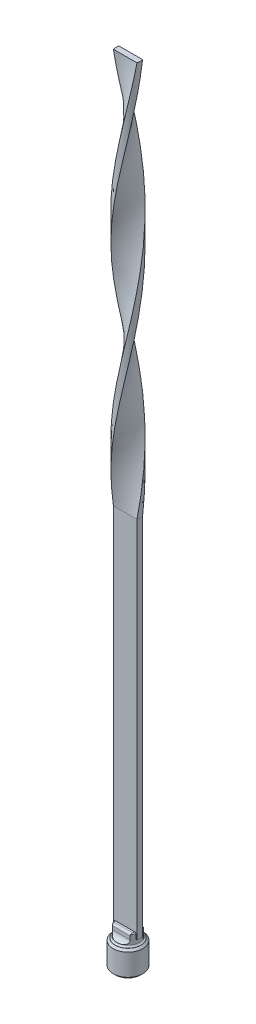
ISO-10303-21;
HEADER;
FILE_DESCRIPTION(('STEP AP214'),'2;1');
FILE_NAME('part.step','',(''),(''),'','','');
FILE_SCHEMA(('AUTOMOTIVE_DESIGN { 1 0 10303 214 1 1 1 1 }'));
ENDSEC;
DATA;
#1=APPLICATION_CONTEXT('core data for automotive mechanical design processes');
#2=APPLICATION_PROTOCOL_DEFINITION('international standard','automotive_design',2000,#1);
#3=PRODUCT_CONTEXT('',#1,'mechanical');
#4=PRODUCT('Part','Part','',(#3));
#5=PRODUCT_RELATED_PRODUCT_CATEGORY('part','',(#4));
#6=PRODUCT_DEFINITION_FORMATION('','',#4);
#7=PRODUCT_DEFINITION_CONTEXT('part definition',#1,'design');
#8=PRODUCT_DEFINITION('design','',#6,#7);
#9=PRODUCT_DEFINITION_SHAPE('','',#8);
#10=(LENGTH_UNIT() NAMED_UNIT(*) SI_UNIT(.MILLI.,.METRE.));
#11=(NAMED_UNIT(*) PLANE_ANGLE_UNIT() SI_UNIT($,.RADIAN.));
#12=(NAMED_UNIT(*) SI_UNIT($,.STERADIAN.) SOLID_ANGLE_UNIT());
#13=UNCERTAINTY_MEASURE_WITH_UNIT(LENGTH_MEASURE(1.E-05),#10,'distance_accuracy_value','');
#14=(GEOMETRIC_REPRESENTATION_CONTEXT(3) GLOBAL_UNCERTAINTY_ASSIGNED_CONTEXT((#13)) GLOBAL_UNIT_ASSIGNED_CONTEXT((#10,
#11,#12)) REPRESENTATION_CONTEXT('',''));
#15=CARTESIAN_POINT('',(0.,0.,0.));
#16=DIRECTION('',(0.,0.,1.));
#17=DIRECTION('',(1.,0.,0.));
#18=AXIS2_PLACEMENT_3D('',#15,#16,#17);
#19=CARTESIAN_POINT('',(0.,5.4102,0.));
#20=DIRECTION('',(0.,-1.,0.));
#21=DIRECTION('',(0.,0.,-1.));
#22=AXIS2_PLACEMENT_3D('',#19,#20,#21);
#23=PLANE('',#22);
#24=DIRECTION('',(-0.866025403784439,0.,0.5));
#25=VECTOR('',#24,1.);
#26=CARTESIAN_POINT('',(0.,5.4102,-2.28769270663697));
#27=LINE('',#26,#25);
#28=CARTESIAN_POINT('',(-1.9812,5.4102,-1.14384635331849));
#29=VERTEX_POINT('',#28);
#30=CARTESIAN_POINT('',(0.,5.4102,-2.28769270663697));
#31=VERTEX_POINT('',#30);
#32=EDGE_CURVE('E979',#29,#31,#27,.F.);
#33=ORIENTED_EDGE('',*,*,#32,.T.);
#34=DIRECTION('',(-0.866025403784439,0.,-0.5));
#35=VECTOR('',#34,1.);
#36=CARTESIAN_POINT('',(1.9812,5.4102,-1.14384635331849));
#37=LINE('',#36,#35);
#38=CARTESIAN_POINT('',(1.9812,5.4102,-1.14384635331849));
#39=VERTEX_POINT('',#38);
#40=EDGE_CURVE('E996',#31,#39,#37,.F.);
#41=ORIENTED_EDGE('',*,*,#40,.T.);
#42=DIRECTION('',(0.,0.,-1.));
#43=VECTOR('',#42,1.);
#44=CARTESIAN_POINT('',(1.9812,5.4102,1.14384635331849));
#45=LINE('',#44,#43);
#46=CARTESIAN_POINT('',(1.9812,5.4102,1.14384635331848));
#47=VERTEX_POINT('',#46);
#48=EDGE_CURVE('E1006',#39,#47,#45,.F.);
#49=ORIENTED_EDGE('',*,*,#48,.T.);
#50=DIRECTION('',(0.866025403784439,0.,-0.5));
#51=VECTOR('',#50,1.);
#52=CARTESIAN_POINT('',(0.,5.4102,2.28769270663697));
#53=LINE('',#52,#51);
#54=CARTESIAN_POINT('',(0.,5.4102,2.28769270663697));
#55=VERTEX_POINT('',#54);
#56=EDGE_CURVE('E1016',#47,#55,#53,.F.);
#57=ORIENTED_EDGE('',*,*,#56,.T.);
#58=DIRECTION('',(0.866025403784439,0.,0.5));
#59=VECTOR('',#58,1.);
#60=CARTESIAN_POINT('',(-1.9812,5.4102,1.14384635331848));
#61=LINE('',#60,#59);
#62=CARTESIAN_POINT('',(-1.9812,5.4102,1.14384635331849));
#63=VERTEX_POINT('',#62);
#64=EDGE_CURVE('E1026',#55,#63,#61,.F.);
#65=ORIENTED_EDGE('',*,*,#64,.T.);
#66=DIRECTION('',(0.,0.,1.));
#67=VECTOR('',#66,1.);
#68=CARTESIAN_POINT('',(-1.9812,5.4102,-1.14384635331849));
#69=LINE('',#68,#67);
#70=EDGE_CURVE('E1030',#63,#29,#69,.F.);
#71=ORIENTED_EDGE('',*,*,#70,.T.);
#72=EDGE_LOOP('',(#33,#41,#49,#57,#65,#71));
#73=FACE_BOUND('',#72,.T.);
#74=ADVANCED_FACE('F15',(#73),#23,.T.);
#75=CARTESIAN_POINT('',(-1.9812,0.,-1.14384635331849));
#76=DIRECTION('',(-1.,0.,0.));
#77=DIRECTION('',(0.,0.,1.));
#78=AXIS2_PLACEMENT_3D('',#75,#76,#77);
#79=PLANE('',#78);
#80=DIRECTION('',(0.,0.,1.));
#81=VECTOR('',#80,1.);
#82=CARTESIAN_POINT('',(-1.9812,0.,-1.14384635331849));
#83=LINE('',#82,#81);
#84=CARTESIAN_POINT('',(-1.9812,0.,-1.14384635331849));
#85=VERTEX_POINT('',#84);
#86=CARTESIAN_POINT('',(-1.9812,-2.84218307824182E-11,-1.14045717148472));
#87=VERTEX_POINT('',#86);
#88=EDGE_CURVE('E154',#85,#87,#83,.T.);
#89=ORIENTED_EDGE('',*,*,#88,.F.);
#90=DIRECTION('',(0.,1.,0.));
#91=VECTOR('',#90,1.);
#92=CARTESIAN_POINT('',(-1.9812,0.,-1.14384635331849));
#93=LINE('',#92,#91);
#94=EDGE_CURVE('E987',#85,#29,#93,.T.);
#95=ORIENTED_EDGE('',*,*,#94,.T.);
#96=ORIENTED_EDGE('',*,*,#70,.F.);
#97=DIRECTION('',(0.,1.,0.));
#98=VECTOR('',#97,1.);
#99=CARTESIAN_POINT('',(-1.9812,0.,1.14384635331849));
#100=LINE('',#99,#98);
#101=CARTESIAN_POINT('',(-1.9812,0.,1.14384635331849));
#102=VERTEX_POINT('',#101);
#103=EDGE_CURVE('E1021',#63,#102,#100,.F.);
#104=ORIENTED_EDGE('',*,*,#103,.T.);
#105=DIRECTION('',(0.,0.,1.));
#106=VECTOR('',#105,1.);
#107=CARTESIAN_POINT('',(-1.9812,0.,-1.14384635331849));
#108=LINE('',#107,#106);
#109=CARTESIAN_POINT('',(-1.9812,-2.84215879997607E-11,1.14045717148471));
#110=VERTEX_POINT('',#109);
#111=EDGE_CURVE('E146',#110,#102,#108,.T.);
#112=ORIENTED_EDGE('',*,*,#111,.F.);
#113=CARTESIAN_POINT('',(-1.9812,-3.09855422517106E-11,1.14045717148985));
#114=CARTESIAN_POINT('',(-1.9812,0.039088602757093,1.0620317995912));
#115=CARTESIAN_POINT('',(-1.9812,0.0758731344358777,0.982297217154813));
#116=CARTESIAN_POINT('',(-1.9812,0.143209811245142,0.81972214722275));
#117=CARTESIAN_POINT('',(-1.9812,0.173724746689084,0.736866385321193));
#118=CARTESIAN_POINT('',(-1.9812,0.2259889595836,0.569794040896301));
#119=CARTESIAN_POINT('',(-1.9812,0.247868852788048,0.485619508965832));
#120=CARTESIAN_POINT('',(-1.9812,0.28157126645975,0.31542781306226));
#121=CARTESIAN_POINT('',(-1.9812,0.293418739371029,0.229415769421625));
#122=CARTESIAN_POINT('',(-1.9812,0.304113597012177,0.081001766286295));
#123=CARTESIAN_POINT('',(-1.9812,0.305686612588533,0.0187887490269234));
#124=CARTESIAN_POINT('',(-1.9812,0.302963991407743,-0.105533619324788));
#125=CARTESIAN_POINT('',(-1.9812,0.298666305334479,-0.167642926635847));
#126=CARTESIAN_POINT('',(-1.9812,0.284446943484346,-0.291272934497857));
#127=CARTESIAN_POINT('',(-1.9812,0.274519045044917,-0.352792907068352));
#128=CARTESIAN_POINT('',(-1.9812,0.249583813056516,-0.474768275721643));
#129=CARTESIAN_POINT('',(-1.9812,0.234576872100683,-0.535223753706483));
#130=CARTESIAN_POINT('',(-1.9812,0.190237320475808,-0.689370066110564));
#131=CARTESIAN_POINT('',(-1.9812,0.157633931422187,-0.782123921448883));
#132=CARTESIAN_POINT('',(-1.9812,0.102626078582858,-0.918529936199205));
#133=CARTESIAN_POINT('',(-1.9812,0.0833037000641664,-0.963484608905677));
#134=CARTESIAN_POINT('',(-1.9812,0.0429026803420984,-1.05256776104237));
#135=CARTESIAN_POINT('',(-1.9812,0.0218250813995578,-1.09669671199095));
#136=CARTESIAN_POINT('',(-1.9812,-3.09860075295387E-11,-1.14045717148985));
#137=B_SPLINE_CURVE_WITH_KNOTS('',3,(#113,#114,#115,#116,#117,#118,#119,#120,#121,#122,#123,
#124,#125,#126,#127,#128,#129,#130,#131,#132,#133,#134,#135,#136),.UNSPECIFIED.,.F.,.F.,(4,2,2,
2,2,2,2,2,2,2,2,4),(0.,0.263061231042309,0.527641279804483,0.788049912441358,1.04780894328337,
1.23424334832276,1.42074284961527,1.6074488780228,1.79414047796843,2.08848357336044,
2.23525258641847,2.38193506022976),.UNSPECIFIED.);
#138=EDGE_CURVE('E391',#110,#87,#137,.T.);
#139=ORIENTED_EDGE('',*,*,#138,.T.);
#140=EDGE_LOOP('',(#89,#95,#96,#104,#112,#139));
#141=FACE_BOUND('',#140,.T.);
#142=ADVANCED_FACE('F400',(#141),#79,.F.);
#143=CARTESIAN_POINT('',(-1.9812,0.,1.14384635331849));
#144=DIRECTION('',(-0.5,0.,0.866025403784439));
#145=DIRECTION('',(0.866025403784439,0.,0.5));
#146=AXIS2_PLACEMENT_3D('',#143,#144,#145);
#147=PLANE('',#146);
#148=DIRECTION('',(0.866025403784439,0.,0.5));
#149=VECTOR('',#148,1.);
#150=CARTESIAN_POINT('',(-1.9812,0.,1.14384635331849));
#151=LINE('',#150,#149);
#152=CARTESIAN_POINT('',(-1.97826488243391,-2.84215880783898E-11,1.14554094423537));
#153=VERTEX_POINT('',#152);
#154=EDGE_CURVE('E1017',#102,#153,#151,.T.);
#155=ORIENTED_EDGE('',*,*,#154,.F.);
#156=ORIENTED_EDGE('',*,*,#103,.F.);
#157=ORIENTED_EDGE('',*,*,#64,.F.);
#158=DIRECTION('',(0.,1.,0.));
#159=VECTOR('',#158,1.);
#160=CARTESIAN_POINT('',(0.,0.,2.28769270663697));
#161=LINE('',#160,#159);
#162=CARTESIAN_POINT('',(0.,0.,2.28769270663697));
#163=VERTEX_POINT('',#162);
#164=EDGE_CURVE('E1011',#55,#163,#161,.F.);
#165=ORIENTED_EDGE('',*,*,#164,.T.);
#166=DIRECTION('',(0.866025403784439,0.,0.5));
#167=VECTOR('',#166,1.);
#168=CARTESIAN_POINT('',(-1.9812,0.,1.14384635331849));
#169=LINE('',#168,#167);
#170=CARTESIAN_POINT('',(-0.00293511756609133,-2.84214839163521E-11,2.28599811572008));
#171=VERTEX_POINT('',#170);
#172=EDGE_CURVE('E1024',#171,#163,#169,.T.);
#173=ORIENTED_EDGE('',*,*,#172,.F.);
#174=CARTESIAN_POINT('',(-0.00293511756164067,-3.0985308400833E-11,2.28599811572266));
#175=CARTESIAN_POINT('',(-0.0708534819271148,0.0390886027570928,2.24678542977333));
#176=CARTESIAN_POINT('',(-0.139905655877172,0.0758731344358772,2.20691813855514));
#177=CARTESIAN_POINT('',(-0.280699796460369,0.143209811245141,2.1256306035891));
#178=CARTESIAN_POINT('',(-0.352454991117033,0.173724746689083,2.08420272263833));
#179=CARTESIAN_POINT('',(-0.497143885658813,0.225988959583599,2.00066655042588));
#180=CARTESIAN_POINT('',(-0.570041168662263,0.247868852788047,1.95857928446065));
#181=CARTESIAN_POINT('',(-0.717431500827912,0.281571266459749,1.87348343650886));
#182=CARTESIAN_POINT('',(-0.791920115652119,0.293418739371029,1.83047741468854));
#183=CARTESIAN_POINT('',(-0.920450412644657,0.304113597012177,1.75627041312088));
#184=CARTESIAN_POINT('',(-0.974328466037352,0.305686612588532,1.72516390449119));
#185=CARTESIAN_POINT('',(-1.08199479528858,0.302963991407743,1.66300272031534));
#186=CARTESIAN_POINT('',(-1.13578303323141,0.298666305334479,1.63194806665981));
#187=CARTESIAN_POINT('',(-1.24284976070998,0.284446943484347,1.5701330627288));
#188=CARTESIAN_POINT('',(-1.29612761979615,0.274519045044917,1.53937307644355));
#189=CARTESIAN_POINT('',(-1.40176138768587,0.249583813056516,1.47838539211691));
#190=CARTESIAN_POINT('',(-1.45411736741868,0.234576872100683,1.44815765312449));
#191=CARTESIAN_POINT('',(-1.5876119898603,0.190237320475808,1.37108449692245));
#192=CARTESIAN_POINT('',(-1.66793918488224,0.157633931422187,1.32470756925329));
#193=CARTESIAN_POINT('',(-1.78607025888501,0.102626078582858,1.25650456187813));
#194=CARTESIAN_POINT('',(-1.82500214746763,0.0833037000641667,1.23402722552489));
#195=CARTESIAN_POINT('',(-1.9021504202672,0.0429026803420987,1.18948564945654));
#196=CARTESIAN_POINT('',(-1.94036721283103,0.0218250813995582,1.16742117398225));
#197=CARTESIAN_POINT('',(-1.97826488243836,-3.09851255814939E-11,1.1455409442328));
#198=B_SPLINE_CURVE_WITH_KNOTS('',3,(#174,#175,#176,#177,#178,#179,#180,#181,#182,#183,#184,
#185,#186,#187,#188,#189,#190,#191,#192,#193,#194,#195,#196,#197),.UNSPECIFIED.,.F.,.F.,(4,2,2,
2,2,2,2,2,2,2,2,4),(0.,0.263061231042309,0.527641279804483,0.788049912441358,1.04780894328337,
1.23424334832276,1.42074284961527,1.6074488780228,1.79414047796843,2.08848357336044,
2.23525258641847,2.38193506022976),.UNSPECIFIED.);
#199=EDGE_CURVE('E384',#171,#153,#198,.T.);
#200=ORIENTED_EDGE('',*,*,#199,.T.);
#201=EDGE_LOOP('',(#155,#156,#157,#165,#173,#200));
#202=FACE_BOUND('',#201,.T.);
#203=ADVANCED_FACE('F397',(#202),#147,.F.);
#204=CARTESIAN_POINT('',(0.,0.,2.28769270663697));
#205=DIRECTION('',(0.5,0.,0.866025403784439));
#206=DIRECTION('',(0.866025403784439,0.,-0.5));
#207=AXIS2_PLACEMENT_3D('',#204,#205,#206);
#208=PLANE('',#207);
#209=DIRECTION('',(0.866025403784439,0.,-0.5));
#210=VECTOR('',#209,1.);
#211=CARTESIAN_POINT('',(0.,0.,2.28769270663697));
#212=LINE('',#211,#210);
#213=CARTESIAN_POINT('',(0.00293511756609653,-2.84214667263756E-11,2.28599811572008));
#214=VERTEX_POINT('',#213);
#215=EDGE_CURVE('E1007',#163,#214,#212,.T.);
#216=ORIENTED_EDGE('',*,*,#215,.F.);
#217=ORIENTED_EDGE('',*,*,#164,.F.);
#218=ORIENTED_EDGE('',*,*,#56,.F.);
#219=DIRECTION('',(0.,1.,0.));
#220=VECTOR('',#219,1.);
#221=CARTESIAN_POINT('',(1.9812,0.,1.14384635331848));
#222=LINE('',#221,#220);
#223=CARTESIAN_POINT('',(1.9812,0.,1.14384635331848));
#224=VERTEX_POINT('',#223);
#225=EDGE_CURVE('E1001',#47,#224,#222,.F.);
#226=ORIENTED_EDGE('',*,*,#225,.T.);
#227=DIRECTION('',(0.866025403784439,0.,-0.5));
#228=VECTOR('',#227,1.);
#229=CARTESIAN_POINT('',(0.,0.,2.28769270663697));
#230=LINE('',#229,#228);
#231=CARTESIAN_POINT('',(1.97826488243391,-2.84215186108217E-11,1.14554094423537));
#232=VERTEX_POINT('',#231);
#233=EDGE_CURVE('E1014',#232,#224,#230,.T.);
#234=ORIENTED_EDGE('',*,*,#233,.F.);
#235=CARTESIAN_POINT('',(1.97826488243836,-3.09878604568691E-11,1.1455409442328));
#236=CARTESIAN_POINT('',(1.91034651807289,0.0390886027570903,1.18475363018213));
#237=CARTESIAN_POINT('',(1.84129434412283,0.0758731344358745,1.22462092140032));
#238=CARTESIAN_POINT('',(1.70050020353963,0.143209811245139,1.30590845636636));
#239=CARTESIAN_POINT('',(1.62874500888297,0.17372474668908,1.34733633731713));
#240=CARTESIAN_POINT('',(1.48405611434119,0.225988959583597,1.43087250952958));
#241=CARTESIAN_POINT('',(1.41115883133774,0.247868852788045,1.47295977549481));
#242=CARTESIAN_POINT('',(1.26376849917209,0.281571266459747,1.5580556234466));
#243=CARTESIAN_POINT('',(1.18927988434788,0.293418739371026,1.60106164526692));
#244=CARTESIAN_POINT('',(1.06074958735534,0.304113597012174,1.67526864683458));
#245=CARTESIAN_POINT('',(1.00687153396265,0.30568661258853,1.70637515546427));
#246=CARTESIAN_POINT('',(0.89920520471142,0.30296399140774,1.76853633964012));
#247=CARTESIAN_POINT('',(0.845416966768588,0.298666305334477,1.79959099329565));
#248=CARTESIAN_POINT('',(0.738350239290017,0.284446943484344,1.86140599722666));
#249=CARTESIAN_POINT('',(0.685072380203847,0.274519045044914,1.89216598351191));
#250=CARTESIAN_POINT('',(0.579438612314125,0.249583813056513,1.95315366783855));
#251=CARTESIAN_POINT('',(0.527082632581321,0.234576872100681,1.98338140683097));
#252=CARTESIAN_POINT('',(0.393588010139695,0.190237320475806,2.06045456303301));
#253=CARTESIAN_POINT('',(0.313260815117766,0.157633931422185,2.10683149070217));
#254=CARTESIAN_POINT('',(0.195129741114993,0.102626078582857,2.17503449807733));
#255=CARTESIAN_POINT('',(0.156197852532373,0.0833037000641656,2.19751183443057));
#256=CARTESIAN_POINT('',(0.0790495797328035,0.0429026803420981,2.24205341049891));
#257=CARTESIAN_POINT('',(0.040832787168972,0.0218250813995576,2.26411788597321));
#258=CARTESIAN_POINT('',(0.00293511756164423,-3.09864500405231E-11,2.28599811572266));
#259=B_SPLINE_CURVE_WITH_KNOTS('',3,(#235,#236,#237,#238,#239,#240,#241,#242,#243,#244,#245,
#246,#247,#248,#249,#250,#251,#252,#253,#254,#255,#256,#257,#258),.UNSPECIFIED.,.F.,.F.,(4,2,2,
2,2,2,2,2,2,2,2,4),(0.,0.263061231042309,0.527641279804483,0.788049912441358,1.04780894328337,
1.23424334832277,1.42074284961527,1.6074488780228,1.79414047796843,2.08848357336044,
2.23525258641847,2.38193506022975),.UNSPECIFIED.);
#260=EDGE_CURVE('E365',#232,#214,#259,.T.);
#261=ORIENTED_EDGE('',*,*,#260,.T.);
#262=EDGE_LOOP('',(#216,#217,#218,#226,#234,#261));
#263=FACE_BOUND('',#262,.T.);
#264=ADVANCED_FACE('F354',(#263),#208,.F.);
#265=CARTESIAN_POINT('',(1.9812,0.,1.14384635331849));
#266=DIRECTION('',(1.,0.,0.));
#267=DIRECTION('',(0.,0.,-1.));
#268=AXIS2_PLACEMENT_3D('',#265,#266,#267);
#269=PLANE('',#268);
#270=DIRECTION('',(0.,0.,-1.));
#271=VECTOR('',#270,1.);
#272=CARTESIAN_POINT('',(1.9812,0.,1.14384635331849));
#273=LINE('',#272,#271);
#274=CARTESIAN_POINT('',(1.9812,-2.84215880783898E-11,1.14045717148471));
#275=VERTEX_POINT('',#274);
#276=EDGE_CURVE('E997',#224,#275,#273,.T.);
#277=ORIENTED_EDGE('',*,*,#276,.F.);
#278=ORIENTED_EDGE('',*,*,#225,.F.);
#279=ORIENTED_EDGE('',*,*,#48,.F.);
#280=DIRECTION('',(0.,1.,0.));
#281=VECTOR('',#280,1.);
#282=CARTESIAN_POINT('',(1.9812,0.,-1.14384635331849));
#283=LINE('',#282,#281);
#284=CARTESIAN_POINT('',(1.9812,0.,-1.14384635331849));
#285=VERTEX_POINT('',#284);
#286=EDGE_CURVE('E992',#39,#285,#283,.F.);
#287=ORIENTED_EDGE('',*,*,#286,.T.);
#288=DIRECTION('',(0.,0.,-1.));
#289=VECTOR('',#288,1.);
#290=CARTESIAN_POINT('',(1.9812,0.,1.14384635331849));
#291=LINE('',#290,#289);
#292=CARTESIAN_POINT('',(1.9812,-2.84217788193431E-11,-1.14045717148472));
#293=VERTEX_POINT('',#292);
#294=EDGE_CURVE('E1004',#293,#285,#291,.T.);
#295=ORIENTED_EDGE('',*,*,#294,.F.);
#296=CARTESIAN_POINT('',(1.9812,-3.0986044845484E-11,-1.14045717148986));
#297=CARTESIAN_POINT('',(1.9812,0.0390886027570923,-1.06203179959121));
#298=CARTESIAN_POINT('',(1.9812,0.0758731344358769,-0.982297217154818));
#299=CARTESIAN_POINT('',(1.9812,0.143209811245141,-0.819722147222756));
#300=CARTESIAN_POINT('',(1.9812,0.173724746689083,-0.736866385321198));
#301=CARTESIAN_POINT('',(1.9812,0.2259889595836,-0.569794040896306));
#302=CARTESIAN_POINT('',(1.9812,0.247868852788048,-0.485619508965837));
#303=CARTESIAN_POINT('',(1.9812,0.28157126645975,-0.315427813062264));
#304=CARTESIAN_POINT('',(1.9812,0.293418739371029,-0.229415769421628));
#305=CARTESIAN_POINT('',(1.9812,0.304113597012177,-0.0810017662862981));
#306=CARTESIAN_POINT('',(1.9812,0.305686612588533,-0.0187887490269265));
#307=CARTESIAN_POINT('',(1.9812,0.302963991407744,0.105533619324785));
#308=CARTESIAN_POINT('',(1.9812,0.29866630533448,0.167642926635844));
#309=CARTESIAN_POINT('',(1.9812,0.284446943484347,0.291272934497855));
#310=CARTESIAN_POINT('',(1.9812,0.274519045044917,0.352792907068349));
#311=CARTESIAN_POINT('',(1.9812,0.249583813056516,0.47476827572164));
#312=CARTESIAN_POINT('',(1.9812,0.234576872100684,0.53522375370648));
#313=CARTESIAN_POINT('',(1.9812,0.190237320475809,0.689370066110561));
#314=CARTESIAN_POINT('',(1.9812,0.157633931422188,0.78212392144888));
#315=CARTESIAN_POINT('',(1.9812,0.102626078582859,0.918529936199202));
#316=CARTESIAN_POINT('',(1.9812,0.0833037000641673,0.963484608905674));
#317=CARTESIAN_POINT('',(1.9812,0.0429026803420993,1.05256776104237));
#318=CARTESIAN_POINT('',(1.9812,0.0218250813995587,1.09669671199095));
#319=CARTESIAN_POINT('',(1.9812,-3.09851446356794E-11,1.14045717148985));
#320=B_SPLINE_CURVE_WITH_KNOTS('',3,(#296,#297,#298,#299,#300,#301,#302,#303,#304,#305,#306,
#307,#308,#309,#310,#311,#312,#313,#314,#315,#316,#317,#318,#319),.UNSPECIFIED.,.F.,.F.,(4,2,2,
2,2,2,2,2,2,2,2,4),(0.,0.26306123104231,0.527641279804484,0.78804991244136,1.04780894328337,
1.23424334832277,1.42074284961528,1.6074488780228,1.79414047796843,2.08848357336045,
2.23525258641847,2.38193506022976),.UNSPECIFIED.);
#321=EDGE_CURVE('E358',#293,#275,#320,.T.);
#322=ORIENTED_EDGE('',*,*,#321,.T.);
#323=EDGE_LOOP('',(#277,#278,#279,#287,#295,#322));
#324=FACE_BOUND('',#323,.T.);
#325=ADVANCED_FACE('F349',(#324),#269,.F.);
#326=CARTESIAN_POINT('',(1.9812,0.,-1.14384635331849));
#327=DIRECTION('',(0.5,0.,-0.866025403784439));
#328=DIRECTION('',(-0.866025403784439,0.,-0.5));
#329=AXIS2_PLACEMENT_3D('',#326,#327,#328);
#330=PLANE('',#329);
#331=DIRECTION('',(-0.866025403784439,0.,-0.5));
#332=VECTOR('',#331,1.);
#333=CARTESIAN_POINT('',(1.9812,0.,-1.14384635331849));
#334=LINE('',#333,#332);
#335=CARTESIAN_POINT('',(1.97826488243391,-2.84218307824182E-11,-1.14554094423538));
#336=VERTEX_POINT('',#335);
#337=EDGE_CURVE('E988',#285,#336,#334,.T.);
#338=ORIENTED_EDGE('',*,*,#337,.F.);
#339=ORIENTED_EDGE('',*,*,#286,.F.);
#340=ORIENTED_EDGE('',*,*,#40,.F.);
#341=DIRECTION('',(0.,1.,0.));
#342=VECTOR('',#341,1.);
#343=CARTESIAN_POINT('',(0.,0.,-2.28769270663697));
#344=LINE('',#343,#342);
#345=CARTESIAN_POINT('',(0.,0.,-2.28769270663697));
#346=VERTEX_POINT('',#345);
#347=EDGE_CURVE('E976',#31,#346,#344,.F.);
#348=ORIENTED_EDGE('',*,*,#347,.T.);
#349=DIRECTION('',(-0.866025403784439,0.,-0.5));
#350=VECTOR('',#349,1.);
#351=CARTESIAN_POINT('',(1.9812,0.,-1.14384635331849));
#352=LINE('',#351,#350);
#353=CARTESIAN_POINT('',(0.00293511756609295,-2.84219522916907E-11,-2.28599811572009));
#354=VERTEX_POINT('',#353);
#355=EDGE_CURVE('E159',#354,#346,#352,.T.);
#356=ORIENTED_EDGE('',*,*,#355,.F.);
#357=CARTESIAN_POINT('',(0.00293511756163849,-3.09882768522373E-11,-2.28599811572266));
#358=CARTESIAN_POINT('',(0.0708534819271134,0.0390886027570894,-2.24678542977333));
#359=CARTESIAN_POINT('',(0.139905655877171,0.075873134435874,-2.20691813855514));
#360=CARTESIAN_POINT('',(0.280699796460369,0.143209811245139,-2.12563060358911));
#361=CARTESIAN_POINT('',(0.352454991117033,0.173724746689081,-2.08420272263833));
#362=CARTESIAN_POINT('',(0.497143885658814,0.225988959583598,-2.00066655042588));
#363=CARTESIAN_POINT('',(0.570041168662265,0.247868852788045,-1.95857928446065));
#364=CARTESIAN_POINT('',(0.717431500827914,0.281571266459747,-1.87348343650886));
#365=CARTESIAN_POINT('',(0.791920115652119,0.293418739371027,-1.83047741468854));
#366=CARTESIAN_POINT('',(0.920450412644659,0.304113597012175,-1.75627041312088));
#367=CARTESIAN_POINT('',(0.974328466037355,0.30568661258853,-1.72516390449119));
#368=CARTESIAN_POINT('',(1.08199479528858,0.30296399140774,-1.66300272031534));
#369=CARTESIAN_POINT('',(1.13578303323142,0.298666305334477,-1.63194806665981));
#370=CARTESIAN_POINT('',(1.24284976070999,0.284446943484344,-1.5701330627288));
#371=CARTESIAN_POINT('',(1.29612761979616,0.274519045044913,-1.53937307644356));
#372=CARTESIAN_POINT('',(1.40176138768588,0.249583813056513,-1.47838539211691));
#373=CARTESIAN_POINT('',(1.45411736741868,0.234576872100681,-1.44815765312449));
#374=CARTESIAN_POINT('',(1.58761198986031,0.190237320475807,-1.37108449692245));
#375=CARTESIAN_POINT('',(1.66793918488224,0.157633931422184,-1.32470756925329));
#376=CARTESIAN_POINT('',(1.78607025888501,0.102626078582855,-1.25650456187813));
#377=CARTESIAN_POINT('',(1.82500214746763,0.083303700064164,-1.23402722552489));
#378=CARTESIAN_POINT('',(1.9021504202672,0.0429026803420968,-1.18948564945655));
#379=CARTESIAN_POINT('',(1.94036721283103,0.0218250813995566,-1.16742117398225));
#380=CARTESIAN_POINT('',(1.97826488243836,-3.09871694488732E-11,-1.1455409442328));
#381=B_SPLINE_CURVE_WITH_KNOTS('',3,(#357,#358,#359,#360,#361,#362,#363,#364,#365,#366,#367,
#368,#369,#370,#371,#372,#373,#374,#375,#376,#377,#378,#379,#380),.UNSPECIFIED.,.F.,.F.,(4,2,2,
2,2,2,2,2,2,2,2,4),(0.,0.26306123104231,0.527641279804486,0.788049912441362,1.04780894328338,
1.23424334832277,1.42074284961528,1.60744887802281,1.79414047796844,2.08848357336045,
2.23525258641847,2.38193506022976),.UNSPECIFIED.);
#382=EDGE_CURVE('E329',#354,#336,#381,.T.);
#383=ORIENTED_EDGE('',*,*,#382,.T.);
#384=EDGE_LOOP('',(#338,#339,#340,#348,#356,#383));
#385=FACE_BOUND('',#384,.T.);
#386=ADVANCED_FACE('F342',(#385),#330,.F.);
#387=CARTESIAN_POINT('',(0.,0.,-2.28769270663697));
#388=DIRECTION('',(-0.5,0.,-0.866025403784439));
#389=DIRECTION('',(-0.866025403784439,0.,0.5));
#390=AXIS2_PLACEMENT_3D('',#387,#388,#389);
#391=PLANE('',#390);
#392=DIRECTION('',(-0.866025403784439,0.,0.5));
#393=VECTOR('',#392,1.);
#394=CARTESIAN_POINT('',(0.,0.,-2.28769270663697));
#395=LINE('',#394,#393);
#396=CARTESIAN_POINT('',(-0.00293511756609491,-2.84219521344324E-11,-2.28599811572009));
#397=VERTEX_POINT('',#396);
#398=EDGE_CURVE('E975',#346,#397,#395,.T.);
#399=ORIENTED_EDGE('',*,*,#398,.F.);
#400=ORIENTED_EDGE('',*,*,#347,.F.);
#401=ORIENTED_EDGE('',*,*,#32,.F.);
#402=ORIENTED_EDGE('',*,*,#94,.F.);
#403=DIRECTION('',(-0.866025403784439,0.,0.5));
#404=VECTOR('',#403,1.);
#405=CARTESIAN_POINT('',(0.,0.,-2.28769270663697));
#406=LINE('',#405,#404);
#407=CARTESIAN_POINT('',(-1.97826488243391,-2.84218829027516E-11,-1.14554094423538));
#408=VERTEX_POINT('',#407);
#409=EDGE_CURVE('E985',#408,#85,#406,.T.);
#410=ORIENTED_EDGE('',*,*,#409,.F.);
#411=CARTESIAN_POINT('',(-1.97826488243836,-3.09882194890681E-11,-1.1455409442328));
#412=CARTESIAN_POINT('',(-1.91034651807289,0.0390886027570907,-1.18475363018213));
#413=CARTESIAN_POINT('',(-1.84129434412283,0.0758731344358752,-1.22462092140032));
#414=CARTESIAN_POINT('',(-1.70050020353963,0.143209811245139,-1.30590845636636));
#415=CARTESIAN_POINT('',(-1.62874500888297,0.173724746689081,-1.34733633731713));
#416=CARTESIAN_POINT('',(-1.48405611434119,0.225988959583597,-1.43087250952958));
#417=CARTESIAN_POINT('',(-1.41115883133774,0.247868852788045,-1.47295977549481));
#418=CARTESIAN_POINT('',(-1.26376849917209,0.281571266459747,-1.5580556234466));
#419=CARTESIAN_POINT('',(-1.18927988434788,0.293418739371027,-1.60106164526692));
#420=CARTESIAN_POINT('',(-1.06074958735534,0.304113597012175,-1.67526864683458));
#421=CARTESIAN_POINT('',(-1.00687153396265,0.305686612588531,-1.70637515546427));
#422=CARTESIAN_POINT('',(-0.899205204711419,0.302963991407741,-1.76853633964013));
#423=CARTESIAN_POINT('',(-0.845416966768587,0.298666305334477,-1.79959099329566));
#424=CARTESIAN_POINT('',(-0.738350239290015,0.284446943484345,-1.86140599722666));
#425=CARTESIAN_POINT('',(-0.685072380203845,0.274519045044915,-1.89216598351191));
#426=CARTESIAN_POINT('',(-0.579438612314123,0.249583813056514,-1.95315366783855));
#427=CARTESIAN_POINT('',(-0.52708263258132,0.234576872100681,-1.98338140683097));
#428=CARTESIAN_POINT('',(-0.393588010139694,0.190237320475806,-2.06045456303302));
#429=CARTESIAN_POINT('',(-0.313260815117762,0.157633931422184,-2.10683149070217));
#430=CARTESIAN_POINT('',(-0.195129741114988,0.102626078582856,-2.17503449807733));
#431=CARTESIAN_POINT('',(-0.156197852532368,0.0833037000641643,-2.19751183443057));
#432=CARTESIAN_POINT('',(-0.0790495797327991,0.0429026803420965,-2.24205341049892));
#433=CARTESIAN_POINT('',(-0.040832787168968,0.0218250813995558,-2.26411788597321));
#434=CARTESIAN_POINT('',(-0.00293511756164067,-3.0988123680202E-11,-2.28599811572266));
#435=B_SPLINE_CURVE_WITH_KNOTS('',3,(#411,#412,#413,#414,#415,#416,#417,#418,#419,#420,#421,
#422,#423,#424,#425,#426,#427,#428,#429,#430,#431,#432,#433,#434),.UNSPECIFIED.,.F.,.F.,(4,2,2,
2,2,2,2,2,2,2,2,4),(0.,0.263061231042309,0.527641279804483,0.788049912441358,1.04780894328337,
1.23424334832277,1.42074284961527,1.6074488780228,1.79414047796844,2.08848357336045,
2.23525258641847,2.38193506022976),.UNSPECIFIED.);
#436=EDGE_CURVE('E319',#408,#397,#435,.T.);
#437=ORIENTED_EDGE('',*,*,#436,.T.);
#438=EDGE_LOOP('',(#399,#400,#401,#402,#410,#437));
#439=FACE_BOUND('',#438,.T.);
#440=ADVANCED_FACE('F337',(#439),#391,.F.);
#441=CARTESIAN_POINT('',(0.,-5.6843418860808E-11,0.));
#442=DIRECTION('',(0.,-1.,0.));
#443=DIRECTION('',(0.,0.,-1.));
#444=AXIS2_PLACEMENT_3D('',#441,#442,#443);
#445=CONICAL_SURFACE('',#444,2.28600000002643,0.785398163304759);
#446=CARTESIAN_POINT('',(0.,-5.6843418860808E-11,0.));
#447=DIRECTION('',(0.,-1.,0.));
#448=DIRECTION('',(0.,0.,-1.));
#449=AXIS2_PLACEMENT_3D('',#446,#447,#448);
#450=CIRCLE('',#449,2.28600000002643);
#451=EDGE_CURVE('E328',#87,#110,#450,.F.);
#452=ORIENTED_EDGE('',*,*,#451,.F.);
#453=ORIENTED_EDGE('',*,*,#138,.F.);
#454=EDGE_LOOP('',(#452,#453));
#455=FACE_BOUND('',#454,.T.);
#456=ADVANCED_FACE('F341',(#455),#445,.F.);
#457=CARTESIAN_POINT('',(0.,-5.6843418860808E-11,0.));
#458=DIRECTION('',(0.,-1.,0.));
#459=DIRECTION('',(0.,0.,-1.));
#460=AXIS2_PLACEMENT_3D('',#457,#458,#459);
#461=CONICAL_SURFACE('',#460,2.28600000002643,0.785398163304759);
#462=CARTESIAN_POINT('',(0.,-5.6843418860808E-11,0.));
#463=DIRECTION('',(0.,-1.,0.));
#464=DIRECTION('',(0.,0.,-1.));
#465=AXIS2_PLACEMENT_3D('',#462,#463,#464);
#466=CIRCLE('',#465,2.28600000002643);
#467=EDGE_CURVE('E969',#153,#171,#466,.F.);
#468=ORIENTED_EDGE('',*,*,#467,.F.);
#469=ORIENTED_EDGE('',*,*,#199,.F.);
#470=EDGE_LOOP('',(#468,#469));
#471=FACE_BOUND('',#470,.T.);
#472=ADVANCED_FACE('F379',(#471),#461,.F.);
#473=CARTESIAN_POINT('',(0.,-5.6843418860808E-11,0.));
#474=DIRECTION('',(0.,-1.,0.));
#475=DIRECTION('',(0.,0.,-1.));
#476=AXIS2_PLACEMENT_3D('',#473,#474,#475);
#477=CONICAL_SURFACE('',#476,2.28600000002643,0.785398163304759);
#478=CARTESIAN_POINT('',(0.,-5.6843418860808E-11,0.));
#479=DIRECTION('',(0.,-1.,0.));
#480=DIRECTION('',(0.,0.,-1.));
#481=AXIS2_PLACEMENT_3D('',#478,#479,#480);
#482=CIRCLE('',#481,2.28600000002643);
#483=EDGE_CURVE('E967',#214,#232,#482,.F.);
#484=ORIENTED_EDGE('',*,*,#483,.F.);
#485=ORIENTED_EDGE('',*,*,#260,.F.);
#486=EDGE_LOOP('',(#484,#485));
#487=FACE_BOUND('',#486,.T.);
#488=ADVANCED_FACE('F375',(#487),#477,.F.);
#489=CARTESIAN_POINT('',(0.,-5.6843418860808E-11,0.));
#490=DIRECTION('',(0.,-1.,0.));
#491=DIRECTION('',(0.,0.,-1.));
#492=AXIS2_PLACEMENT_3D('',#489,#490,#491);
#493=CONICAL_SURFACE('',#492,2.28600000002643,0.785398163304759);
#494=CARTESIAN_POINT('',(0.,-5.6843418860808E-11,0.));
#495=DIRECTION('',(0.,-1.,0.));
#496=DIRECTION('',(0.,0.,-1.));
#497=AXIS2_PLACEMENT_3D('',#494,#495,#496);
#498=CIRCLE('',#497,2.28600000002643);
#499=EDGE_CURVE('E964',#275,#293,#498,.F.);
#500=ORIENTED_EDGE('',*,*,#499,.F.);
#501=ORIENTED_EDGE('',*,*,#321,.F.);
#502=EDGE_LOOP('',(#500,#501));
#503=FACE_BOUND('',#502,.T.);
#504=ADVANCED_FACE('F372',(#503),#493,.F.);
#505=CARTESIAN_POINT('',(0.,-5.6843418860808E-11,0.));
#506=DIRECTION('',(0.,-1.,0.));
#507=DIRECTION('',(0.,0.,-1.));
#508=AXIS2_PLACEMENT_3D('',#505,#506,#507);
#509=CONICAL_SURFACE('',#508,2.28600000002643,0.785398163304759);
#510=CARTESIAN_POINT('',(0.,-5.6843418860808E-11,0.));
#511=DIRECTION('',(0.,-1.,0.));
#512=DIRECTION('',(0.,0.,-1.));
#513=AXIS2_PLACEMENT_3D('',#510,#511,#512);
#514=CIRCLE('',#513,2.28600000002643);
#515=EDGE_CURVE('E962',#336,#354,#514,.F.);
#516=ORIENTED_EDGE('',*,*,#515,.F.);
#517=ORIENTED_EDGE('',*,*,#382,.F.);
#518=EDGE_LOOP('',(#516,#517));
#519=FACE_BOUND('',#518,.T.);
#520=ADVANCED_FACE('F314',(#519),#509,.F.);
#521=CARTESIAN_POINT('',(0.,-5.6843418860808E-11,0.));
#522=DIRECTION('',(0.,-1.,0.));
#523=DIRECTION('',(0.,0.,-1.));
#524=AXIS2_PLACEMENT_3D('',#521,#522,#523);
#525=CONICAL_SURFACE('',#524,2.28600000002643,0.785398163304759);
#526=CARTESIAN_POINT('',(0.,-5.6843418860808E-11,0.));
#527=DIRECTION('',(0.,-1.,0.));
#528=DIRECTION('',(0.,0.,-1.));
#529=AXIS2_PLACEMENT_3D('',#526,#527,#528);
#530=CIRCLE('',#529,2.28600000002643);
#531=EDGE_CURVE('E959',#397,#408,#530,.F.);
#532=ORIENTED_EDGE('',*,*,#531,.F.);
#533=ORIENTED_EDGE('',*,*,#436,.F.);
#534=EDGE_LOOP('',(#532,#533));
#535=FACE_BOUND('',#534,.T.);
#536=ADVANCED_FACE('F310',(#535),#525,.F.);
#537=CARTESIAN_POINT('',(0.,0.,-1.905));
#538=DIRECTION('',(0.,-1.,0.));
#539=DIRECTION('',(0.,0.,-1.));
#540=AXIS2_PLACEMENT_3D('',#537,#538,#539);
#541=PLANE('',#540);
#542=ORIENTED_EDGE('',*,*,#531,.T.);
#543=ORIENTED_EDGE('',*,*,#409,.T.);
#544=ORIENTED_EDGE('',*,*,#88,.T.);
#545=ORIENTED_EDGE('',*,*,#451,.T.);
#546=ORIENTED_EDGE('',*,*,#111,.T.);
#547=ORIENTED_EDGE('',*,*,#154,.T.);
#548=ORIENTED_EDGE('',*,*,#467,.T.);
#549=ORIENTED_EDGE('',*,*,#172,.T.);
#550=ORIENTED_EDGE('',*,*,#215,.T.);
#551=ORIENTED_EDGE('',*,*,#483,.T.);
#552=ORIENTED_EDGE('',*,*,#233,.T.);
#553=ORIENTED_EDGE('',*,*,#276,.T.);
#554=ORIENTED_EDGE('',*,*,#499,.T.);
#555=ORIENTED_EDGE('',*,*,#294,.T.);
#556=ORIENTED_EDGE('',*,*,#337,.T.);
#557=ORIENTED_EDGE('',*,*,#515,.T.);
#558=ORIENTED_EDGE('',*,*,#355,.T.);
#559=ORIENTED_EDGE('',*,*,#398,.T.);
#560=EDGE_LOOP('',(#542,#543,#544,#545,#546,#547,#548,#549,#550,#551,#552,#553,#554,#555,#556,
#557,#558,#559));
#561=FACE_BOUND('',#560,.T.);
#562=CARTESIAN_POINT('',(0.,-1.13687705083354E-10,0.));
#563=DIRECTION('',(0.,1.,0.));
#564=DIRECTION('',(0.,0.,1.));
#565=AXIS2_PLACEMENT_3D('',#562,#563,#564);
#566=CIRCLE('',#565,3.30200000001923);
#567=CARTESIAN_POINT('',(0.,-1.13687705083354E-10,3.30200000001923));
#568=VERTEX_POINT('',#567);
#569=EDGE_CURVE('E956',#568,#568,#566,.T.);
#570=ORIENTED_EDGE('',*,*,#569,.F.);
#571=EDGE_LOOP('',(#570));
#572=FACE_BOUND('',#571,.T.);
#573=ADVANCED_FACE('F306',(#561,#572),#541,.T.);
#574=CARTESIAN_POINT('',(0.,0.505999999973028,0.));
#575=DIRECTION('',(0.,1.,0.));
#576=DIRECTION('',(0.,0.,1.));
#577=AXIS2_PLACEMENT_3D('',#574,#575,#576);
#578=CONICAL_SURFACE('',#577,3.80800000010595,0.785398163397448);
#579=CARTESIAN_POINT('',(0.,0.506,0.));
#580=DIRECTION('',(0.,-1.,0.));
#581=DIRECTION('',(0.,0.,-1.));
#582=AXIS2_PLACEMENT_3D('',#579,#580,#581);
#583=CIRCLE('',#582,3.808);
#584=CARTESIAN_POINT('',(0.,0.506,-3.808));
#585=VERTEX_POINT('',#584);
#586=EDGE_CURVE('E241',#585,#585,#583,.F.);
#587=ORIENTED_EDGE('',*,*,#586,.F.);
#588=EDGE_LOOP('',(#587));
#589=FACE_BOUND('',#588,.T.);
#590=ORIENTED_EDGE('',*,*,#569,.T.);
#591=EDGE_LOOP('',(#590));
#592=FACE_BOUND('',#591,.T.);
#593=ADVANCED_FACE('F302',(#589,#592),#578,.T.);
#594=CARTESIAN_POINT('',(0.,3.302,0.));
#595=DIRECTION('',(0.,-1.,0.));
#596=DIRECTION('',(0.,0.,-1.));
#597=AXIS2_PLACEMENT_3D('',#594,#595,#596);
#598=CYLINDRICAL_SURFACE('',#597,3.808);
#599=CARTESIAN_POINT('',(0.,6.0980000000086,0.));
#600=DIRECTION('',(0.,-1.,0.));
#601=DIRECTION('',(0.,0.,1.));
#602=AXIS2_PLACEMENT_3D('',#599,#600,#601);
#603=CIRCLE('',#602,3.80799999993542);
#604=CARTESIAN_POINT('',(0.,6.0980000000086,3.80799999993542));
#605=VERTEX_POINT('',#604);
#606=EDGE_CURVE('E955',#605,#605,#603,.F.);
#607=ORIENTED_EDGE('',*,*,#606,.F.);
#608=EDGE_LOOP('',(#607));
#609=FACE_BOUND('',#608,.T.);
#610=ORIENTED_EDGE('',*,*,#586,.T.);
#611=EDGE_LOOP('',(#610));
#612=FACE_BOUND('',#611,.T.);
#613=ADVANCED_FACE('F298',(#609,#612),#598,.T.);
#614=CARTESIAN_POINT('',(0.,6.0980000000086,0.));
#615=DIRECTION('',(0.,-1.,0.));
#616=DIRECTION('',(1.,0.,0.));
#617=AXIS2_PLACEMENT_3D('',#614,#615,#616);
#618=CONICAL_SURFACE('',#617,3.80799999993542,0.785398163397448);
#619=CARTESIAN_POINT('',(0.,6.60399999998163,0.));
#620=DIRECTION('',(0.,-1.,0.));
#621=DIRECTION('',(1.,0.,0.));
#622=AXIS2_PLACEMENT_3D('',#619,#620,#621);
#623=CIRCLE('',#622,3.30199999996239);
#624=CARTESIAN_POINT('',(3.30199999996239,6.60399999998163,0.));
#625=VERTEX_POINT('',#624);
#626=EDGE_CURVE('E232',#625,#625,#623,.F.);
#627=ORIENTED_EDGE('',*,*,#626,.F.);
#628=EDGE_LOOP('',(#627));
#629=FACE_BOUND('',#628,.T.);
#630=ORIENTED_EDGE('',*,*,#606,.T.);
#631=EDGE_LOOP('',(#630));
#632=FACE_BOUND('',#631,.T.);
#633=ADVANCED_FACE('F287',(#629,#632),#618,.T.);
#634=CARTESIAN_POINT('',(0.,6.604,-3.81));
#635=DIRECTION('',(0.,1.,0.));
#636=DIRECTION('',(0.,0.,1.));
#637=AXIS2_PLACEMENT_3D('',#634,#635,#636);
#638=PLANE('',#637);
#639=CARTESIAN_POINT('',(0.,6.604,0.));
#640=DIRECTION('',(0.,1.,0.));
#641=DIRECTION('',(0.,0.,-1.));
#642=AXIS2_PLACEMENT_3D('',#639,#640,#641);
#643=CIRCLE('',#642,3.2385);
#644=CARTESIAN_POINT('',(0.,6.604,3.2385));
#645=VERTEX_POINT('',#644);
#646=CARTESIAN_POINT('',(0.,6.604,-3.2385));
#647=VERTEX_POINT('',#646);
#648=EDGE_CURVE('E222',#645,#647,#643,.F.);
#649=ORIENTED_EDGE('',*,*,#648,.T.);
#650=CARTESIAN_POINT('',(0.,6.604,0.));
#651=DIRECTION('',(0.,1.,0.));
#652=DIRECTION('',(0.,0.,1.));
#653=AXIS2_PLACEMENT_3D('',#650,#651,#652);
#654=CIRCLE('',#653,3.2385);
#655=EDGE_CURVE('E217',#647,#645,#654,.F.);
#656=ORIENTED_EDGE('',*,*,#655,.T.);
#657=EDGE_LOOP('',(#649,#656));
#658=FACE_BOUND('',#657,.T.);
#659=ORIENTED_EDGE('',*,*,#626,.T.);
#660=EDGE_LOOP('',(#659));
#661=FACE_BOUND('',#660,.T.);
#662=ADVANCED_FACE('F220',(#658,#661),#638,.T.);
#663=CARTESIAN_POINT('',(0.,6.985,6.6421002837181));
#664=DIRECTION('',(0.,-1.,0.));
#665=DIRECTION('',(0.,0.,-1.));
#666=AXIS2_PLACEMENT_3D('',#663,#664,#665);
#667=PLANE('',#666);
#668=DIRECTION('',(1.,0.,0.));
#669=VECTOR('',#668,1.);
#670=CARTESIAN_POINT('',(0.,6.985,2.8321));
#671=LINE('',#670,#669);
#672=CARTESIAN_POINT('',(0.380152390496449,6.985,2.8321));
#673=VERTEX_POINT('',#672);
#674=CARTESIAN_POINT('',(-0.380152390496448,6.985,2.8321));
#675=VERTEX_POINT('',#674);
#676=EDGE_CURVE('E276',#673,#675,#671,.F.);
#677=ORIENTED_EDGE('',*,*,#676,.T.);
#678=CARTESIAN_POINT('',(0.,6.985,0.));
#679=DIRECTION('',(0.,-1.,0.));
#680=DIRECTION('',(0.,0.,-1.));
#681=AXIS2_PLACEMENT_3D('',#678,#679,#680);
#682=CIRCLE('',#681,2.8575);
#683=EDGE_CURVE('E226',#675,#673,#682,.F.);
#684=ORIENTED_EDGE('',*,*,#683,.T.);
#685=EDGE_LOOP('',(#677,#684));
#686=FACE_BOUND('',#685,.T.);
#687=ADVANCED_FACE('F254',(#686),#667,.F.);
#688=CARTESIAN_POINT('',(0.,6.985,0.));
#689=DIRECTION('',(0.,-1.,0.));
#690=DIRECTION('',(0.,0.,-1.));
#691=AXIS2_PLACEMENT_3D('',#688,#689,#690);
#692=TOROIDAL_SURFACE('',#691,3.2385,0.381);
#693=ORIENTED_EDGE('',*,*,#648,.F.);
#694=ORIENTED_EDGE('',*,*,#655,.F.);
#695=EDGE_LOOP('',(#693,#694));
#696=FACE_BOUND('',#695,.T.);
#697=CARTESIAN_POINT('',(0.,6.985,0.));
#698=DIRECTION('',(0.,-1.,0.));
#699=DIRECTION('',(0.,0.,-1.));
#700=AXIS2_PLACEMENT_3D('',#697,#698,#699);
#701=CIRCLE('',#700,2.8575);
#702=CARTESIAN_POINT('',(0.380152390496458,6.985,-2.8321));
#703=VERTEX_POINT('',#702);
#704=EDGE_CURVE('E1453',#673,#703,#701,.F.);
#705=ORIENTED_EDGE('',*,*,#704,.F.);
#706=ORIENTED_EDGE('',*,*,#683,.F.);
#707=CARTESIAN_POINT('',(0.,6.985,0.));
#708=DIRECTION('',(0.,-1.,0.));
#709=DIRECTION('',(0.,0.,-1.));
#710=AXIS2_PLACEMENT_3D('',#707,#708,#709);
#711=CIRCLE('',#710,2.8575);
#712=CARTESIAN_POINT('',(-0.380152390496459,6.985,-2.8321));
#713=VERTEX_POINT('',#712);
#714=EDGE_CURVE('E756',#713,#675,#711,.F.);
#715=ORIENTED_EDGE('',*,*,#714,.F.);
#716=CARTESIAN_POINT('',(0.380152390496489,6.985,-2.8321));
#717=CARTESIAN_POINT('',(0.33802601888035,6.98500505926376,-2.83775528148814));
#718=CARTESIAN_POINT('',(0.295773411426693,6.98504309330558,-2.84246933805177));
#719=CARTESIAN_POINT('',(0.211266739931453,6.98513560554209,-2.84999371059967));
#720=CARTESIAN_POINT('',(0.169013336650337,6.98519001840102,-2.85281144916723));
#721=CARTESIAN_POINT('',(0.0845065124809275,6.98526652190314,-2.85656279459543));
#722=CARTESIAN_POINT('',(0.0422532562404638,6.98528867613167,-2.8575001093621));
#723=CARTESIAN_POINT('',(-0.0422532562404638,6.98528867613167,-2.8575001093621));
#724=CARTESIAN_POINT('',(-0.0845065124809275,6.98526652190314,-2.85656279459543));
#725=CARTESIAN_POINT('',(-0.169013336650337,6.98519001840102,-2.85281144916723));
#726=CARTESIAN_POINT('',(-0.211266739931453,6.98513560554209,-2.84999371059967));
#727=CARTESIAN_POINT('',(-0.295773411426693,6.98504309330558,-2.84246933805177));
#728=CARTESIAN_POINT('',(-0.33802601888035,6.98500505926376,-2.83775528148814));
#729=CARTESIAN_POINT('',(-0.380152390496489,6.985,-2.8321));
#730=B_SPLINE_CURVE_WITH_KNOTS('',3,(#716,#717,#718,#719,#720,#721,#722,#723,#724,#725,#726,
#727,#728,#729),.UNSPECIFIED.,.F.,.F.,(4,2,2,2,2,2,4),(0.,0.127502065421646,0.254502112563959,
0.381251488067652,0.508000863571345,0.635000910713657,0.762502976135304),.UNSPECIFIED.);
#731=EDGE_CURVE('E946',#703,#713,#730,.T.);
#732=ORIENTED_EDGE('',*,*,#731,.F.);
#733=EDGE_LOOP('',(#705,#706,#715,#732));
#734=FACE_BOUND('',#733,.T.);
#735=ADVANCED_FACE('F230',(#696,#734),#692,.F.);
#736=CARTESIAN_POINT('',(0.,8.1026,2.8321));
#737=DIRECTION('',(1.,0.,0.));
#738=DIRECTION('',(0.,0.,-1.));
#739=AXIS2_PLACEMENT_3D('',#736,#737,#738);
#740=CYLINDRICAL_SURFACE('',#739,1.1176);
#741=ORIENTED_EDGE('',*,*,#676,.F.);
#742=CARTESIAN_POINT('',(2.28600000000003,8.1026,1.7145));
#743=CARTESIAN_POINT('',(2.28599868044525,8.07660409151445,1.71449808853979));
#744=CARTESIAN_POINT('',(2.28531941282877,8.05062141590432,1.7154078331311));
#745=CARTESIAN_POINT('',(2.28260235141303,7.99885800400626,1.71902308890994));
#746=CARTESIAN_POINT('',(2.28056483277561,7.97307722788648,1.72172823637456));
#747=CARTESIAN_POINT('',(2.27243357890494,7.89650193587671,1.73246562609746));
#748=CARTESIAN_POINT('',(2.26432113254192,7.84625133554,1.74312032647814));
#749=CARTESIAN_POINT('',(2.2427589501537,7.74878062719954,1.77077411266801));
#750=CARTESIAN_POINT('',(2.22930990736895,7.70156012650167,1.78777237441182));
#751=CARTESIAN_POINT('',(2.19720687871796,7.61128194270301,1.82708227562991));
#752=CARTESIAN_POINT('',(2.17855133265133,7.56822551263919,1.84939550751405));
#753=CARTESIAN_POINT('',(2.13572335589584,7.48602509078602,1.89870526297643));
#754=CARTESIAN_POINT('',(2.11141471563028,7.44701930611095,1.92581262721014));
#755=CARTESIAN_POINT('',(2.05801853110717,7.37472790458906,1.98277425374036));
#756=CARTESIAN_POINT('',(2.02892868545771,7.3414450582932,2.01262983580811));
#757=CARTESIAN_POINT('',(1.95390397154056,7.26834518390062,2.0859753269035));
#758=CARTESIAN_POINT('',(1.90590351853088,7.23129572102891,2.13011341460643));
#759=CARTESIAN_POINT('',(1.80310441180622,7.16737464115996,2.21781542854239));
#760=CARTESIAN_POINT('',(1.74829472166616,7.14051984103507,2.26137829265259));
#761=CARTESIAN_POINT('',(1.64963880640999,7.10164774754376,2.33380048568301));
#762=CARTESIAN_POINT('',(1.60706394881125,7.087581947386,2.36333975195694));
#763=CARTESIAN_POINT('',(1.51962443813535,7.06309365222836,2.42049184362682));
#764=CARTESIAN_POINT('',(1.47475874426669,7.05267283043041,2.44810377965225));
#765=CARTESIAN_POINT('',(1.33695914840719,7.02579476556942,2.52766434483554));
#766=CARTESIAN_POINT('',(1.24109966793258,7.01382009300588,2.57613266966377));
#767=CARTESIAN_POINT('',(1.08181395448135,7.00033647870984,2.6456427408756));
#768=CARTESIAN_POINT('',(1.01997669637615,6.99657733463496,2.67009103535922));
#769=CARTESIAN_POINT('',(0.894634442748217,6.99096072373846,2.71465493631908));
#770=CARTESIAN_POINT('',(0.831128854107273,6.98910394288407,2.73476897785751));
#771=CARTESIAN_POINT('',(0.703521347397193,6.98656590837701,2.77032631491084));
#772=CARTESIAN_POINT('',(0.639432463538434,6.98587265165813,2.78581592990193));
#773=CARTESIAN_POINT('',(0.510380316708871,6.98510378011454,2.81232265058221));
#774=CARTESIAN_POINT('',(0.445417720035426,6.98502771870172,2.82334298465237));
#775=CARTESIAN_POINT('',(0.380152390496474,6.985,2.8321));
#776=B_SPLINE_CURVE_WITH_KNOTS('',3,(#742,#743,#744,#745,#746,#747,#748,#749,#750,#751,#752,
#753,#754,#755,#756,#757,#758,#759,#760,#761,#762,#763,#764,#765,#766,#767,#768,#769,#770,#771,
#772,#773,#774,#775),.UNSPECIFIED.,.F.,.F.,(4,2,2,2,2,2,2,2,2,2,2,2,2,2,2,2,4),(0.,
0.0779369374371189,0.155858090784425,0.311040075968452,0.466201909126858,0.621410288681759,
0.780838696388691,0.940344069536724,1.16409398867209,1.38821141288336,1.54907855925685,
1.71001945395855,2.03296347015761,2.2326198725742,2.43234824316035,2.63000323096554,
2.82751518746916),.UNSPECIFIED.);
#777=CARTESIAN_POINT('',(2.28600000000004,8.1026,1.7145));
#778=VERTEX_POINT('',#777);
#779=EDGE_CURVE('E930',#778,#673,#776,.T.);
#780=ORIENTED_EDGE('',*,*,#779,.F.);
#781=DIRECTION('',(-1.,0.,0.));
#782=VECTOR('',#781,1.);
#783=CARTESIAN_POINT('',(0.,8.1026,1.7145));
#784=LINE('',#783,#782);
#785=CARTESIAN_POINT('',(-2.28600000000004,8.1026,1.7145));
#786=VERTEX_POINT('',#785);
#787=EDGE_CURVE('E1460',#778,#786,#784,.T.);
#788=ORIENTED_EDGE('',*,*,#787,.T.);
#789=CARTESIAN_POINT('',(-0.380152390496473,6.985,2.8321));
#790=CARTESIAN_POINT('',(-0.418967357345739,6.98500266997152,2.82688984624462));
#791=CARTESIAN_POINT('',(-0.457670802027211,6.9850361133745,2.82088225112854));
#792=CARTESIAN_POINT('',(-0.534799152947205,6.98525439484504,2.80728160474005));
#793=CARTESIAN_POINT('',(-0.573224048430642,6.98543923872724,2.79968849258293));
#794=CARTESIAN_POINT('',(-0.688117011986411,6.98635664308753,2.77451859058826));
#795=CARTESIAN_POINT('',(-0.764077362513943,6.98745265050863,2.75456815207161));
#796=CARTESIAN_POINT('',(-0.914906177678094,6.99163881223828,2.70823699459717));
#797=CARTESIAN_POINT('',(-0.989752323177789,6.99475155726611,2.68178556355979));
#798=CARTESIAN_POINT('',(-1.13673717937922,7.00435691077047,2.62286026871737));
#799=CARTESIAN_POINT('',(-1.20887866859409,7.01084594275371,2.59039280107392));
#800=CARTESIAN_POINT('',(-1.36173954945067,7.03042004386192,2.51385278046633));
#801=CARTESIAN_POINT('',(-1.44183398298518,7.04443844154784,2.46874573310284));
#802=CARTESIAN_POINT('',(-1.59535526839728,7.08261253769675,2.3724015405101));
#803=CARTESIAN_POINT('',(-1.66881004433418,7.10672312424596,2.3211923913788));
#804=CARTESIAN_POINT('',(-1.79110939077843,7.16147986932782,2.22749680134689));
#805=CARTESIAN_POINT('',(-1.84172554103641,7.18934162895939,2.18571795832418));
#806=CARTESIAN_POINT('',(-1.93650283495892,7.25462052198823,2.10219707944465));
#807=CARTESIAN_POINT('',(-1.9806696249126,7.29202921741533,2.06045504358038));
#808=CARTESIAN_POINT('',(-2.05370812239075,7.36925903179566,1.98739934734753));
#809=CARTESIAN_POINT('',(-2.08389781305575,7.40735355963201,1.95558505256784));
#810=CARTESIAN_POINT('',(-2.13842050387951,7.49022968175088,1.89581119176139));
#811=CARTESIAN_POINT('',(-2.16275511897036,7.53500942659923,1.86785056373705));
#812=CARTESIAN_POINT('',(-2.20520009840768,7.63072917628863,1.81755203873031));
#813=CARTESIAN_POINT('',(-2.22327322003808,7.68170368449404,1.79524798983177));
#814=CARTESIAN_POINT('',(-2.25270472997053,7.78813372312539,1.7581794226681));
#815=CARTESIAN_POINT('',(-2.26406991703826,7.84358465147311,1.74340727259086));
#816=CARTESIAN_POINT('',(-2.27668887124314,7.93342266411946,1.72686169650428));
#817=CARTESIAN_POINT('',(-2.28018131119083,7.9670084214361,1.72223814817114));
#818=CARTESIAN_POINT('',(-2.28483466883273,8.03458887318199,1.71605417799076));
#819=CARTESIAN_POINT('',(-2.28599772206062,8.06858316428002,1.71449095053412));
#820=CARTESIAN_POINT('',(-2.28600000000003,8.1026,1.7145));
#821=B_SPLINE_CURVE_WITH_KNOTS('',3,(#789,#790,#791,#792,#793,#794,#795,#796,#797,#798,#799,
#800,#801,#802,#803,#804,#805,#806,#807,#808,#809,#810,#811,#812,#813,#814,#815,#816,#817,#818,
#819,#820),.UNSPECIFIED.,.F.,.F.,(4,2,2,2,2,2,2,2,2,2,2,2,2,2,2,4),(0.,0.117471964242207,
0.234948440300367,0.470281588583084,0.708297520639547,0.946061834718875,1.22422091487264,
1.50114968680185,1.71429427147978,1.92725111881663,2.100811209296,2.27432337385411,
2.4488505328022,2.62320049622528,2.72524564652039,2.82719720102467),.UNSPECIFIED.);
#822=EDGE_CURVE('E754',#675,#786,#821,.T.);
#823=ORIENTED_EDGE('',*,*,#822,.F.);
#824=EDGE_LOOP('',(#741,#780,#788,#823));
#825=FACE_BOUND('',#824,.T.);
#826=ADVANCED_FACE('F253',(#825),#740,.F.);
#827=CARTESIAN_POINT('',(0.,8.06450000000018,0.));
#828=DIRECTION('',(0.,-1.,0.));
#829=DIRECTION('',(0.,0.,-1.));
#830=AXIS2_PLACEMENT_3D('',#827,#828,#829);
#831=CYLINDRICAL_SURFACE('',#830,2.8575);
#832=DIRECTION('',(0.,-1.,0.));
#833=VECTOR('',#832,1.);
#834=CARTESIAN_POINT('',(2.76428562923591,8.06450000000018,-0.7239));
#835=LINE('',#834,#833);
#836=CARTESIAN_POINT('',(2.76428562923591,9.271,-0.7239));
#837=VERTEX_POINT('',#836);
#838=CARTESIAN_POINT('',(2.76428562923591,8.001,-0.7239));
#839=VERTEX_POINT('',#838);
#840=EDGE_CURVE('E199',#837,#839,#835,.T.);
#841=ORIENTED_EDGE('',*,*,#840,.T.);
#842=CARTESIAN_POINT('',(0.,8.001,0.));
#843=DIRECTION('',(0.,-1.,0.));
#844=DIRECTION('',(0.,0.,-1.));
#845=AXIS2_PLACEMENT_3D('',#842,#843,#844);
#846=CIRCLE('',#845,2.8575);
#847=CARTESIAN_POINT('',(2.76428562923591,8.001,0.7239));
#848=VERTEX_POINT('',#847);
#849=EDGE_CURVE('E272',#839,#848,#846,.T.);
#850=ORIENTED_EDGE('',*,*,#849,.T.);
#851=DIRECTION('',(0.,-1.,0.));
#852=VECTOR('',#851,1.);
#853=CARTESIAN_POINT('',(2.76428562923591,8.06450000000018,0.7239));
#854=LINE('',#853,#852);
#855=CARTESIAN_POINT('',(2.76428562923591,9.271,0.7239));
#856=VERTEX_POINT('',#855);
#857=EDGE_CURVE('E273',#848,#856,#854,.F.);
#858=ORIENTED_EDGE('',*,*,#857,.T.);
#859=CARTESIAN_POINT('',(0.,9.271,0.));
#860=DIRECTION('',(0.,-1.,0.));
#861=DIRECTION('',(0.,0.,-1.));
#862=AXIS2_PLACEMENT_3D('',#859,#860,#861);
#863=CIRCLE('',#862,2.8575);
#864=CARTESIAN_POINT('',(2.33549536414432,9.271,1.64644090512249));
#865=VERTEX_POINT('',#864);
#866=EDGE_CURVE('E275',#856,#865,#863,.T.);
#867=ORIENTED_EDGE('',*,*,#866,.T.);
#868=CARTESIAN_POINT('',(2.33549536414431,9.271,1.64644090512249));
#869=CARTESIAN_POINT('',(2.32711430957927,9.25045802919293,1.65832633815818));
#870=CARTESIAN_POINT('',(2.31952240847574,9.22876240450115,1.66890508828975));
#871=CARTESIAN_POINT('',(2.30654707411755,9.18415445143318,1.6867924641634));
#872=CARTESIAN_POINT('',(2.30111175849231,9.16128790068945,1.69417835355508));
#873=CARTESIAN_POINT('',(2.29335388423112,9.11846499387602,1.7046613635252));
#874=CARTESIAN_POINT('',(2.29065110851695,9.09870792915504,1.70828555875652));
#875=CARTESIAN_POINT('',(2.28694587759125,9.05831449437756,1.71323903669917));
#876=CARTESIAN_POINT('',(2.28598165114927,9.03766834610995,1.71451673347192));
#877=CARTESIAN_POINT('',(2.28600000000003,9.017,1.7145));
#878=B_SPLINE_CURVE_WITH_KNOTS('',3,(#868,#869,#870,#871,#872,#873,#874,#875,#876,#877),
.UNSPECIFIED.,.F.,.F.,(4,2,2,2,4),(0.,0.0755339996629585,0.149120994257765,0.209711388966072,
0.271618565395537),.UNSPECIFIED.);
#879=CARTESIAN_POINT('',(2.28600000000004,9.017,1.7145));
#880=VERTEX_POINT('',#879);
#881=EDGE_CURVE('E806',#865,#880,#878,.T.);
#882=ORIENTED_EDGE('',*,*,#881,.T.);
#883=DIRECTION('',(0.,1.,0.));
#884=VECTOR('',#883,1.);
#885=CARTESIAN_POINT('',(2.28600000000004,6.985,1.7145));
#886=LINE('',#885,#884);
#887=EDGE_CURVE('E1462',#880,#778,#886,.F.);
#888=ORIENTED_EDGE('',*,*,#887,.T.);
#889=ORIENTED_EDGE('',*,*,#779,.T.);
#890=ORIENTED_EDGE('',*,*,#704,.T.);
#891=CARTESIAN_POINT('',(0.380152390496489,6.985,-2.8321));
#892=CARTESIAN_POINT('',(0.418967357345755,6.98500266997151,-2.82688984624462));
#893=CARTESIAN_POINT('',(0.457670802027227,6.9850361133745,-2.82088225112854));
#894=CARTESIAN_POINT('',(0.534799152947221,6.98525439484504,-2.80728160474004));
#895=CARTESIAN_POINT('',(0.573224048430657,6.98543923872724,-2.79968849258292));
#896=CARTESIAN_POINT('',(0.688117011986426,6.98635664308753,-2.77451859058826));
#897=CARTESIAN_POINT('',(0.764077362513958,6.98745265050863,-2.75456815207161));
#898=CARTESIAN_POINT('',(0.914906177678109,6.99163881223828,-2.70823699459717));
#899=CARTESIAN_POINT('',(0.989752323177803,6.99475155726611,-2.68178556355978));
#900=CARTESIAN_POINT('',(1.13673717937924,7.00435691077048,-2.62286026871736));
#901=CARTESIAN_POINT('',(1.2088786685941,7.01084594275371,-2.59039280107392));
#902=CARTESIAN_POINT('',(1.36173954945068,7.03042004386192,-2.51385278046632));
#903=CARTESIAN_POINT('',(1.44183398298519,7.04443844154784,-2.46874573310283));
#904=CARTESIAN_POINT('',(1.59535526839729,7.08261253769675,-2.37240154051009));
#905=CARTESIAN_POINT('',(1.66881004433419,7.10672312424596,-2.32119239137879));
#906=CARTESIAN_POINT('',(1.79110939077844,7.16147986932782,-2.22749680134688));
#907=CARTESIAN_POINT('',(1.84172554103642,7.1893416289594,-2.18571795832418));
#908=CARTESIAN_POINT('',(1.93650283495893,7.25462052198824,-2.10219707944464));
#909=CARTESIAN_POINT('',(1.9806696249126,7.29202921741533,-2.06045504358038));
#910=CARTESIAN_POINT('',(2.05370812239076,7.36925903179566,-1.98739934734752));
#911=CARTESIAN_POINT('',(2.08389781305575,7.40735355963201,-1.95558505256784));
#912=CARTESIAN_POINT('',(2.13842050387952,7.49022968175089,-1.89581119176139));
#913=CARTESIAN_POINT('',(2.16275511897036,7.53500942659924,-1.86785056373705));
#914=CARTESIAN_POINT('',(2.20520009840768,7.63072917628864,-1.81755203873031));
#915=CARTESIAN_POINT('',(2.22327322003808,7.68170368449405,-1.79524798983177));
#916=CARTESIAN_POINT('',(2.25270472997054,7.7881337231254,-1.7581794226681));
#917=CARTESIAN_POINT('',(2.26406991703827,7.84358465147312,-1.74340727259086));
#918=CARTESIAN_POINT('',(2.27668887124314,7.93342266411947,-1.72686169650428));
#919=CARTESIAN_POINT('',(2.28018131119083,7.9670084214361,-1.72223814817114));
#920=CARTESIAN_POINT('',(2.28483466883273,8.034588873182,-1.71605417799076));
#921=CARTESIAN_POINT('',(2.28599772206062,8.06858316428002,-1.71449095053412));
#922=CARTESIAN_POINT('',(2.28600000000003,8.1026,-1.7145));
#923=B_SPLINE_CURVE_WITH_KNOTS('',3,(#891,#892,#893,#894,#895,#896,#897,#898,#899,#900,#901,
#902,#903,#904,#905,#906,#907,#908,#909,#910,#911,#912,#913,#914,#915,#916,#917,#918,#919,#920,
#921,#922),.UNSPECIFIED.,.F.,.F.,(4,2,2,2,2,2,2,2,2,2,2,2,2,2,2,4),(0.,0.117471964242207,
0.234948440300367,0.470281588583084,0.708297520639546,0.946061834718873,1.22422091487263,
1.50114968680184,1.71429427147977,1.92725111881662,2.10081120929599,2.27432337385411,
2.4488505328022,2.62320049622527,2.72524564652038,2.82719720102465),.UNSPECIFIED.);
#924=CARTESIAN_POINT('',(2.28600000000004,8.1026,-1.7145));
#925=VERTEX_POINT('',#924);
#926=EDGE_CURVE('E760',#703,#925,#923,.T.);
#927=ORIENTED_EDGE('',*,*,#926,.T.);
#928=DIRECTION('',(0.,-1.,0.));
#929=VECTOR('',#928,1.);
#930=CARTESIAN_POINT('',(2.28600000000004,8.06450000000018,-1.7145));
#931=LINE('',#930,#929);
#932=CARTESIAN_POINT('',(2.28600000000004,9.017,-1.7145));
#933=VERTEX_POINT('',#932);
#934=EDGE_CURVE('E923',#925,#933,#931,.F.);
#935=ORIENTED_EDGE('',*,*,#934,.T.);
#936=CARTESIAN_POINT('',(2.28600000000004,9.017,-1.7145));
#937=CARTESIAN_POINT('',(2.28595922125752,9.04216276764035,-1.71453821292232));
#938=CARTESIAN_POINT('',(2.2874006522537,9.06727897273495,-1.71263305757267));
#939=CARTESIAN_POINT('',(2.29285493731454,9.11606219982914,-1.70533169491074));
#940=CARTESIAN_POINT('',(2.29680185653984,9.13974980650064,-1.700024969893));
#941=CARTESIAN_POINT('',(2.3060384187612,9.18172259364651,-1.68746527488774));
#942=CARTESIAN_POINT('',(2.31098117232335,9.20023705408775,-1.68070290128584));
#943=CARTESIAN_POINT('',(2.32225338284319,9.2364346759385,-1.66509485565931));
#944=CARTESIAN_POINT('',(2.32861034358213,9.25409144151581,-1.6562075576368));
#945=CARTESIAN_POINT('',(2.33549536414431,9.271,-1.64644090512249));
#946=B_SPLINE_CURVE_WITH_KNOTS('',3,(#936,#937,#938,#939,#940,#941,#942,#943,#944,#945),
.UNSPECIFIED.,.F.,.F.,(4,2,2,2,4),(0.,0.0753042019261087,0.14870448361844,0.209502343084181,
0.271606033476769),.UNSPECIFIED.);
#947=CARTESIAN_POINT('',(2.33549536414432,9.271,-1.64644090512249));
#948=VERTEX_POINT('',#947);
#949=EDGE_CURVE('E920',#933,#948,#946,.T.);
#950=ORIENTED_EDGE('',*,*,#949,.T.);
#951=CARTESIAN_POINT('',(0.,9.271,0.));
#952=DIRECTION('',(0.,-1.,0.));
#953=DIRECTION('',(0.,0.,-1.));
#954=AXIS2_PLACEMENT_3D('',#951,#952,#953);
#955=CIRCLE('',#954,2.8575);
#956=EDGE_CURVE('E206',#948,#837,#955,.T.);
#957=ORIENTED_EDGE('',*,*,#956,.T.);
#958=EDGE_LOOP('',(#841,#850,#858,#867,#882,#888,#889,#890,#927,#935,#950,#957));
#959=FACE_BOUND('',#958,.T.);
#960=ADVANCED_FACE('F915',(#959),#831,.T.);
#961=CARTESIAN_POINT('',(0.,8.06450000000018,0.));
#962=DIRECTION('',(0.,-1.,0.));
#963=DIRECTION('',(0.,0.,-1.));
#964=AXIS2_PLACEMENT_3D('',#961,#962,#963);
#965=CYLINDRICAL_SURFACE('',#964,2.8575);
#966=CARTESIAN_POINT('',(-2.28600000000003,9.017,1.7145));
#967=CARTESIAN_POINT('',(-2.28595922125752,9.04216276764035,1.71453821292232));
#968=CARTESIAN_POINT('',(-2.2874006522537,9.06727897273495,1.71263305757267));
#969=CARTESIAN_POINT('',(-2.29285493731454,9.11606219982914,1.70533169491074));
#970=CARTESIAN_POINT('',(-2.29680185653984,9.13974980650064,1.700024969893));
#971=CARTESIAN_POINT('',(-2.3060384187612,9.18172259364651,1.68746527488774));
#972=CARTESIAN_POINT('',(-2.31098117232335,9.20023705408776,1.68070290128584));
#973=CARTESIAN_POINT('',(-2.32225338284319,9.2364346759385,1.6650948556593));
#974=CARTESIAN_POINT('',(-2.32861034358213,9.25409144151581,1.6562075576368));
#975=CARTESIAN_POINT('',(-2.33549536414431,9.271,1.64644090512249));
#976=B_SPLINE_CURVE_WITH_KNOTS('',3,(#966,#967,#968,#969,#970,#971,#972,#973,#974,#975),
.UNSPECIFIED.,.F.,.F.,(4,2,2,2,4),(0.,0.075304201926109,0.148704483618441,0.209502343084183,
0.271606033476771),.UNSPECIFIED.);
#977=CARTESIAN_POINT('',(-2.28600000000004,9.017,1.7145));
#978=VERTEX_POINT('',#977);
#979=CARTESIAN_POINT('',(-2.33549536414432,9.271,1.64644090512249));
#980=VERTEX_POINT('',#979);
#981=EDGE_CURVE('E737',#978,#980,#976,.T.);
#982=ORIENTED_EDGE('',*,*,#981,.T.);
#983=CARTESIAN_POINT('',(0.,9.271,0.));
#984=DIRECTION('',(0.,-1.,0.));
#985=DIRECTION('',(0.,0.,-1.));
#986=AXIS2_PLACEMENT_3D('',#983,#984,#985);
#987=CIRCLE('',#986,2.8575);
#988=CARTESIAN_POINT('',(-2.76428562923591,9.271,0.7239));
#989=VERTEX_POINT('',#988);
#990=EDGE_CURVE('E726',#980,#989,#987,.T.);
#991=ORIENTED_EDGE('',*,*,#990,.T.);
#992=DIRECTION('',(0.,-1.,0.));
#993=VECTOR('',#992,1.);
#994=CARTESIAN_POINT('',(-2.76428562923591,8.06450000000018,0.7239));
#995=LINE('',#994,#993);
#996=CARTESIAN_POINT('',(-2.76428562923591,8.001,0.7239));
#997=VERTEX_POINT('',#996);
#998=EDGE_CURVE('E264',#989,#997,#995,.T.);
#999=ORIENTED_EDGE('',*,*,#998,.T.);
#1000=CARTESIAN_POINT('',(0.,8.001,0.));
#1001=DIRECTION('',(0.,-1.,0.));
#1002=DIRECTION('',(0.,0.,-1.));
#1003=AXIS2_PLACEMENT_3D('',#1000,#1001,#1002);
#1004=CIRCLE('',#1003,2.8575);
#1005=CARTESIAN_POINT('',(-2.76428562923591,8.001,-0.7239));
#1006=VERTEX_POINT('',#1005);
#1007=EDGE_CURVE('E270',#997,#1006,#1004,.T.);
#1008=ORIENTED_EDGE('',*,*,#1007,.T.);
#1009=DIRECTION('',(0.,-1.,0.));
#1010=VECTOR('',#1009,1.);
#1011=CARTESIAN_POINT('',(-2.76428562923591,8.06450000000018,-0.7239));
#1012=LINE('',#1011,#1010);
#1013=CARTESIAN_POINT('',(-2.76428562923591,9.271,-0.7239));
#1014=VERTEX_POINT('',#1013);
#1015=EDGE_CURVE('E266',#1006,#1014,#1012,.F.);
#1016=ORIENTED_EDGE('',*,*,#1015,.T.);
#1017=CARTESIAN_POINT('',(0.,9.271,0.));
#1018=DIRECTION('',(0.,-1.,0.));
#1019=DIRECTION('',(0.,0.,-1.));
#1020=AXIS2_PLACEMENT_3D('',#1017,#1018,#1019);
#1021=CIRCLE('',#1020,2.8575);
#1022=CARTESIAN_POINT('',(-2.33549536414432,9.271,-1.64644090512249));
#1023=VERTEX_POINT('',#1022);
#1024=EDGE_CURVE('E269',#1014,#1023,#1021,.T.);
#1025=ORIENTED_EDGE('',*,*,#1024,.T.);
#1026=CARTESIAN_POINT('',(-2.33549536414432,9.271,-1.64644090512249));
#1027=CARTESIAN_POINT('',(-2.32711430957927,9.25045802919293,-1.65832633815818));
#1028=CARTESIAN_POINT('',(-2.31952240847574,9.22876240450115,-1.66890508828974));
#1029=CARTESIAN_POINT('',(-2.30654707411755,9.18415445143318,-1.6867924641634));
#1030=CARTESIAN_POINT('',(-2.30111175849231,9.16128790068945,-1.69417835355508));
#1031=CARTESIAN_POINT('',(-2.29335388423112,9.11846499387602,-1.7046613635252));
#1032=CARTESIAN_POINT('',(-2.29065110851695,9.09870792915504,-1.70828555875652));
#1033=CARTESIAN_POINT('',(-2.28694587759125,9.05831449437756,-1.71323903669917));
#1034=CARTESIAN_POINT('',(-2.28598165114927,9.03766834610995,-1.71451673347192));
#1035=CARTESIAN_POINT('',(-2.28600000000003,9.017,-1.7145));
#1036=B_SPLINE_CURVE_WITH_KNOTS('',3,(#1026,#1027,#1028,#1029,#1030,#1031,#1032,#1033,#1034,
#1035),.UNSPECIFIED.,.F.,.F.,(4,2,2,2,4),(0.,0.0755339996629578,0.149120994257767,
0.209711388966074,0.271618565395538),.UNSPECIFIED.);
#1037=CARTESIAN_POINT('',(-2.28600000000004,9.017,-1.7145));
#1038=VERTEX_POINT('',#1037);
#1039=EDGE_CURVE('E1440',#1023,#1038,#1036,.T.);
#1040=ORIENTED_EDGE('',*,*,#1039,.T.);
#1041=DIRECTION('',(0.,-1.,0.));
#1042=VECTOR('',#1041,1.);
#1043=CARTESIAN_POINT('',(-2.28600000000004,8.06450000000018,-1.7145));
#1044=LINE('',#1043,#1042);
#1045=CARTESIAN_POINT('',(-2.28600000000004,8.1026,-1.7145));
#1046=VERTEX_POINT('',#1045);
#1047=EDGE_CURVE('E1442',#1038,#1046,#1044,.T.);
#1048=ORIENTED_EDGE('',*,*,#1047,.T.);
#1049=CARTESIAN_POINT('',(-2.28600000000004,8.1026,-1.7145));
#1050=CARTESIAN_POINT('',(-2.28599868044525,8.07660409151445,-1.71449808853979));
#1051=CARTESIAN_POINT('',(-2.28531941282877,8.05062141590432,-1.7154078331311));
#1052=CARTESIAN_POINT('',(-2.28260235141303,7.99885800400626,-1.71902308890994));
#1053=CARTESIAN_POINT('',(-2.28056483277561,7.97307722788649,-1.72172823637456));
#1054=CARTESIAN_POINT('',(-2.27243357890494,7.89650193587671,-1.73246562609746));
#1055=CARTESIAN_POINT('',(-2.26432113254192,7.84625133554,-1.74312032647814));
#1056=CARTESIAN_POINT('',(-2.2427589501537,7.74878062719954,-1.77077411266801));
#1057=CARTESIAN_POINT('',(-2.22930990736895,7.70156012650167,-1.78777237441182));
#1058=CARTESIAN_POINT('',(-2.19720687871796,7.61128194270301,-1.82708227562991));
#1059=CARTESIAN_POINT('',(-2.17855133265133,7.56822551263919,-1.84939550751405));
#1060=CARTESIAN_POINT('',(-2.13572335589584,7.48602509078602,-1.89870526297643));
#1061=CARTESIAN_POINT('',(-2.11141471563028,7.44701930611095,-1.92581262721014));
#1062=CARTESIAN_POINT('',(-2.05801853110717,7.37472790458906,-1.98277425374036));
#1063=CARTESIAN_POINT('',(-2.02892868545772,7.3414450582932,-2.01262983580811));
#1064=CARTESIAN_POINT('',(-1.95390397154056,7.26834518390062,-2.0859753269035));
#1065=CARTESIAN_POINT('',(-1.90590351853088,7.23129572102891,-2.13011341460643));
#1066=CARTESIAN_POINT('',(-1.80310441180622,7.16737464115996,-2.2178154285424));
#1067=CARTESIAN_POINT('',(-1.74829472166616,7.14051984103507,-2.26137829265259));
#1068=CARTESIAN_POINT('',(-1.64963880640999,7.10164774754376,-2.33380048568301));
#1069=CARTESIAN_POINT('',(-1.60706394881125,7.087581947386,-2.36333975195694));
#1070=CARTESIAN_POINT('',(-1.51962443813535,7.06309365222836,-2.42049184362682));
#1071=CARTESIAN_POINT('',(-1.47475874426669,7.05267283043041,-2.44810377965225));
#1072=CARTESIAN_POINT('',(-1.33695914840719,7.02579476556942,-2.52766434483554));
#1073=CARTESIAN_POINT('',(-1.24109966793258,7.01382009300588,-2.57613266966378));
#1074=CARTESIAN_POINT('',(-1.08181395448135,7.00033647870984,-2.6456427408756));
#1075=CARTESIAN_POINT('',(-1.01997669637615,6.99657733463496,-2.67009103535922));
#1076=CARTESIAN_POINT('',(-0.89463444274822,6.99096072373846,-2.71465493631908));
#1077=CARTESIAN_POINT('',(-0.831128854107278,6.98910394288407,-2.7347689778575));
#1078=CARTESIAN_POINT('',(-0.703521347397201,6.98656590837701,-2.77032631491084));
#1079=CARTESIAN_POINT('',(-0.639432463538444,6.98587265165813,-2.78581592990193));
#1080=CARTESIAN_POINT('',(-0.510380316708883,6.98510378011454,-2.81232265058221));
#1081=CARTESIAN_POINT('',(-0.445417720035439,6.98502771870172,-2.82334298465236));
#1082=CARTESIAN_POINT('',(-0.380152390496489,6.985,-2.8321));
#1083=B_SPLINE_CURVE_WITH_KNOTS('',3,(#1049,#1050,#1051,#1052,#1053,#1054,#1055,#1056,#1057,
#1058,#1059,#1060,#1061,#1062,#1063,#1064,#1065,#1066,#1067,#1068,#1069,#1070,#1071,#1072,#1073,
#1074,#1075,#1076,#1077,#1078,#1079,#1080,#1081,#1082),.UNSPECIFIED.,.F.,.F.,(4,2,2,2,2,2,2,2,2,
2,2,2,2,2,2,2,4),(0.,0.077936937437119,0.155858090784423,0.311040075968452,0.466201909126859,
0.621410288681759,0.780838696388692,0.940344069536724,1.16409398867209,1.38821141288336,
1.54907855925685,1.71001945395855,2.03296347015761,2.2326198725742,2.43234824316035,
2.63000323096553,2.82751518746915),.UNSPECIFIED.);
#1084=EDGE_CURVE('E895',#1046,#713,#1083,.T.);
#1085=ORIENTED_EDGE('',*,*,#1084,.T.);
#1086=ORIENTED_EDGE('',*,*,#714,.T.);
#1087=ORIENTED_EDGE('',*,*,#822,.T.);
#1088=DIRECTION('',(0.,1.,0.));
#1089=VECTOR('',#1088,1.);
#1090=CARTESIAN_POINT('',(-2.28600000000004,6.985,1.7145));
#1091=LINE('',#1090,#1089);
#1092=EDGE_CURVE('E736',#786,#978,#1091,.T.);
#1093=ORIENTED_EDGE('',*,*,#1092,.T.);
#1094=EDGE_LOOP('',(#982,#991,#999,#1008,#1016,#1025,#1040,#1048,#1085,#1086,#1087,#1093));
#1095=FACE_BOUND('',#1094,.T.);
#1096=ADVANCED_FACE('F751',(#1095),#965,.T.);
#1097=CARTESIAN_POINT('',(0.,6.985,1.7145));
#1098=DIRECTION('',(0.,0.,-1.));
#1099=DIRECTION('',(-1.,0.,0.));
#1100=AXIS2_PLACEMENT_3D('',#1097,#1098,#1099);
#1101=PLANE('',#1100);
#1102=ORIENTED_EDGE('',*,*,#887,.F.);
#1103=DIRECTION('',(1.,0.,0.));
#1104=VECTOR('',#1103,1.);
#1105=CARTESIAN_POINT('',(0.,9.017,1.7145));
#1106=LINE('',#1105,#1104);
#1107=EDGE_CURVE('E811',#978,#880,#1106,.T.);
#1108=ORIENTED_EDGE('',*,*,#1107,.F.);
#1109=ORIENTED_EDGE('',*,*,#1092,.F.);
#1110=ORIENTED_EDGE('',*,*,#787,.F.);
#1111=EDGE_LOOP('',(#1102,#1108,#1109,#1110));
#1112=FACE_BOUND('',#1111,.T.);
#1113=ADVANCED_FACE('F1165',(#1112),#1101,.F.);
#1114=CARTESIAN_POINT('',(0.,8.1026,-2.8321));
#1115=DIRECTION('',(1.,0.,0.));
#1116=DIRECTION('',(0.,0.,-1.));
#1117=AXIS2_PLACEMENT_3D('',#1114,#1115,#1116);
#1118=CYLINDRICAL_SURFACE('',#1117,1.1176);
#1119=DIRECTION('',(1.,0.,0.));
#1120=VECTOR('',#1119,1.);
#1121=CARTESIAN_POINT('',(0.,8.1026,-1.7145));
#1122=LINE('',#1121,#1120);
#1123=EDGE_CURVE('E748',#1046,#925,#1122,.T.);
#1124=ORIENTED_EDGE('',*,*,#1123,.T.);
#1125=ORIENTED_EDGE('',*,*,#926,.F.);
#1126=ORIENTED_EDGE('',*,*,#731,.T.);
#1127=ORIENTED_EDGE('',*,*,#1084,.F.);
#1128=EDGE_LOOP('',(#1124,#1125,#1126,#1127));
#1129=FACE_BOUND('',#1128,.T.);
#1130=ADVANCED_FACE('F785',(#1129),#1118,.F.);
#1131=CARTESIAN_POINT('',(0.,9.017,1.2065));
#1132=DIRECTION('',(1.,0.,0.));
#1133=DIRECTION('',(0.,0.,-1.));
#1134=AXIS2_PLACEMENT_3D('',#1131,#1132,#1133);
#1135=CYLINDRICAL_SURFACE('',#1134,0.508);
#1136=ORIENTED_EDGE('',*,*,#881,.F.);
#1137=CARTESIAN_POINT('',(2.3070695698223,9.525,1.20649999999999));
#1138=CARTESIAN_POINT('',(2.30877268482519,9.5250000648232,1.21269292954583));
#1139=CARTESIAN_POINT('',(2.31046522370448,9.52488675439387,1.21888884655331));
#1140=CARTESIAN_POINT('',(2.31379521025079,9.52443582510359,1.23118670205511));
#1141=CARTESIAN_POINT('',(2.31543310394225,9.52410162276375,1.23728864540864));
#1142=CARTESIAN_POINT('',(2.31864674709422,9.52321826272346,1.24939163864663));
#1143=CARTESIAN_POINT('',(2.32022306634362,9.52267251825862,1.25539278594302));
#1144=CARTESIAN_POINT('',(2.32330742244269,9.52137589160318,1.2672875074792));
#1145=CARTESIAN_POINT('',(2.32481614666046,9.52062841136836,1.27318127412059));
#1146=CARTESIAN_POINT('',(2.32776001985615,9.51893840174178,1.28485490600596));
#1147=CARTESIAN_POINT('',(2.32919596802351,9.51799925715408,1.29063505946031));
#1148=CARTESIAN_POINT('',(2.33198982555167,9.51593624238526,1.30207548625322));
#1149=CARTESIAN_POINT('',(2.33334863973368,9.51481573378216,1.30773614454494));
#1150=CARTESIAN_POINT('',(2.33598456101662,9.51240047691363,1.3189319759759));
#1151=CARTESIAN_POINT('',(2.33726267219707,9.51110906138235,1.32446763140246));
#1152=CARTESIAN_POINT('',(2.33973428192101,9.5083625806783,1.33540823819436));
#1153=CARTESIAN_POINT('',(2.34092887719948,9.5069108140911,1.34081376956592));
#1154=CARTESIAN_POINT('',(2.34323127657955,9.5038542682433,1.35148930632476));
#1155=CARTESIAN_POINT('',(2.34434026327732,9.50225274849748,1.35675998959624));
#1156=CARTESIAN_POINT('',(2.34646995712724,9.49890732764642,1.36716141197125));
#1157=CARTESIAN_POINT('',(2.34749192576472,9.49716664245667,1.37229292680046));
#1158=CARTESIAN_POINT('',(2.34944674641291,9.49355346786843,1.38241200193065));
#1159=CARTESIAN_POINT('',(2.35038093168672,9.49168414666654,1.38740043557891));
#1160=CARTESIAN_POINT('',(2.35215996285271,9.48782417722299,1.39722974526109));
#1161=CARTESIAN_POINT('',(2.35300620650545,9.48583664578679,1.40207159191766));
#1162=CARTESIAN_POINT('',(2.35460969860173,9.48175059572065,1.41160453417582));
#1163=CARTESIAN_POINT('',(2.35536840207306,9.47965513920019,1.41629669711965));
#1164=CARTESIAN_POINT('',(2.35679771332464,9.47536339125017,1.42552746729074));
#1165=CARTESIAN_POINT('',(2.35746982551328,9.47317010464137,1.43006723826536));
#1166=CARTESIAN_POINT('',(2.35872726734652,9.46869267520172,1.43899086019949));
#1167=CARTESIAN_POINT('',(2.35931414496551,9.46641147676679,1.44337596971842));
#1168=CARTESIAN_POINT('',(2.36040317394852,9.46176782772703,1.45198812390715));
#1169=CARTESIAN_POINT('',(2.36090690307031,9.45940826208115,1.45621652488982));
#1170=CARTESIAN_POINT('',(2.36190153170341,9.45425241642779,1.46514678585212));
#1171=CARTESIAN_POINT('',(2.36238250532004,9.45143893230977,1.46983983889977));
#1172=CARTESIAN_POINT('',(2.36324502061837,9.44564669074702,1.47915208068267));
#1173=CARTESIAN_POINT('',(2.36362625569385,9.44266745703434,1.48377100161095));
#1174=CARTESIAN_POINT('',(2.36428146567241,9.43654625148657,1.49292781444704));
#1175=CARTESIAN_POINT('',(2.36455511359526,9.43340381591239,1.49746541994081));
#1176=CARTESIAN_POINT('',(2.36498700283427,9.42695964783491,1.50645235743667));
#1177=CARTESIAN_POINT('',(2.36514489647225,9.42365746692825,1.51090138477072));
#1178=CARTESIAN_POINT('',(2.36533725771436,9.41689792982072,1.51970375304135));
#1179=CARTESIAN_POINT('',(2.36537135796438,9.41344014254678,1.52405677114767));
#1180=CARTESIAN_POINT('',(2.36530816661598,9.40637428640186,1.53265959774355));
#1181=CARTESIAN_POINT('',(2.36521048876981,9.40276580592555,1.5369090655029));
#1182=CARTESIAN_POINT('',(2.36487589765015,9.3954042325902,1.54529717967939));
#1183=CARTESIAN_POINT('',(2.36463858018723,9.39165074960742,1.54943546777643));
#1184=CARTESIAN_POINT('',(2.3640170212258,9.38400564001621,1.55759355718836));
#1185=CARTESIAN_POINT('',(2.36363235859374,9.38011364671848,1.56161298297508));
#1186=CARTESIAN_POINT('',(2.36270862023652,9.3721987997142,1.56952566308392));
#1187=CARTESIAN_POINT('',(2.36216910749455,9.36817560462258,1.57341852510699));
#1188=CARTESIAN_POINT('',(2.3609284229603,9.36000646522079,1.58107041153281));
#1189=CARTESIAN_POINT('',(2.36022679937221,9.35586020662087,1.58482902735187));
#1190=CARTESIAN_POINT('',(2.35865493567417,9.34745388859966,1.59220481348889));
#1191=CARTESIAN_POINT('',(2.35778423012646,9.34319354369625,1.59582155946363));
#1192=CARTESIAN_POINT('',(2.35586758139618,9.3345688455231,1.60290609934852));
#1193=CARTESIAN_POINT('',(2.35482116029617,9.33020423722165,1.60637345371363));
#1194=CARTESIAN_POINT('',(2.35254683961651,9.32138164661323,1.61315184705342));
#1195=CARTESIAN_POINT('',(2.35131845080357,9.31692344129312,1.61646243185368));
#1196=CARTESIAN_POINT('',(2.34867439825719,9.30792514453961,1.62292012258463));
#1197=CARTESIAN_POINT('',(2.34725823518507,9.30338486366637,1.62606676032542));
#1198=CARTESIAN_POINT('',(2.34423327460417,9.29423469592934,1.63218960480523));
#1199=CARTESIAN_POINT('',(2.34262396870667,9.2896246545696,1.63516532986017));
#1200=CARTESIAN_POINT('',(2.33920806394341,9.28034822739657,1.64093979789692));
#1201=CARTESIAN_POINT('',(2.33740094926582,9.27568172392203,1.64373804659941));
#1202=CARTESIAN_POINT('',(2.33549536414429,9.271,1.64644090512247));
#1203=B_SPLINE_CURVE_WITH_KNOTS('',3,(#1137,#1138,#1139,#1140,#1141,#1142,#1143,#1144,#1145,
#1146,#1147,#1148,#1149,#1150,#1151,#1152,#1153,#1154,#1155,#1156,#1157,#1158,#1159,#1160,#1161,
#1162,#1163,#1164,#1165,#1166,#1167,#1168,#1169,#1170,#1171,#1172,#1173,#1174,#1175,#1176,#1177,
#1178,#1179,#1180,#1181,#1182,#1183,#1184,#1185,#1186,#1187,#1188,#1189,#1190,#1191,#1192,#1193,
#1194,#1195,#1196,#1197,#1198,#1199,#1200,#1201,#1202),.UNSPECIFIED.,.F.,.F.,(4,2,2,2,2,2,2,2,2,
2,2,2,2,2,2,2,2,2,2,2,2,2,2,2,2,2,2,2,2,2,2,2,4),(0.,0.0192676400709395,0.038244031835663,
0.0569261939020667,0.0753111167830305,0.093395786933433,0.111177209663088,0.128652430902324,
0.145818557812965,0.162672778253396,0.179212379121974,0.19543476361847,0.211337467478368,
0.22691817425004,0.24217472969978,0.257105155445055,0.271707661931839,0.288182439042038,
0.304707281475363,0.321281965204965,0.337906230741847,0.354579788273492,0.371302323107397,
0.388073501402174,0.404892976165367,0.421760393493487,0.438675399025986,0.455637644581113,
0.472646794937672,0.489702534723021,0.506804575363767,0.523952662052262,0.54114658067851),.UNSPECIFIED.);
#1204=CARTESIAN_POINT('',(2.30706956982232,9.525,1.2065));
#1205=VERTEX_POINT('',#1204);
#1206=EDGE_CURVE('E805',#865,#1205,#1203,.F.);
#1207=ORIENTED_EDGE('',*,*,#1206,.T.);
#1208=DIRECTION('',(1.,0.,0.));
#1209=VECTOR('',#1208,1.);
#1210=CARTESIAN_POINT('',(0.,9.525,1.2065));
#1211=LINE('',#1210,#1209);
#1212=CARTESIAN_POINT('',(-2.30706956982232,9.525,1.2065));
#1213=VERTEX_POINT('',#1212);
#1214=EDGE_CURVE('E745',#1213,#1205,#1211,.T.);
#1215=ORIENTED_EDGE('',*,*,#1214,.F.);
#1216=CARTESIAN_POINT('',(-2.33549536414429,9.271,1.64644090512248));
#1217=CARTESIAN_POINT('',(-2.33740061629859,9.27568090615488,1.64373851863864));
#1218=CARTESIAN_POINT('',(-2.33920743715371,9.28034659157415,1.64094076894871));
#1219=CARTESIAN_POINT('',(-2.34262286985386,9.28962149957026,1.63516728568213));
#1220=CARTESIAN_POINT('',(-2.3442319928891,9.29423083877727,1.63219204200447));
#1221=CARTESIAN_POINT('',(-2.34725668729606,9.30337972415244,1.62607013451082));
#1222=CARTESIAN_POINT('',(-2.34867276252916,9.307919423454,1.6229239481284));
#1223=CARTESIAN_POINT('',(-2.35131672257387,9.31691668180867,1.61646712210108));
#1224=CARTESIAN_POINT('',(-2.35254510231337,9.32137442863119,1.61315694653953));
#1225=CARTESIAN_POINT('',(-2.35481947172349,9.33019622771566,1.6063793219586));
#1226=CARTESIAN_POINT('',(-2.35586594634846,9.33456050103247,1.60291232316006));
#1227=CARTESIAN_POINT('',(-2.35778275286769,9.34318465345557,1.59582843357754));
#1228=CARTESIAN_POINT('',(-2.35865355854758,9.34744478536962,1.59221197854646));
#1229=CARTESIAN_POINT('',(-2.36022565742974,9.35585079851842,1.58483670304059));
#1230=CARTESIAN_POINT('',(-2.36092741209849,9.35999696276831,1.58107830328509));
#1231=CARTESIAN_POINT('',(-2.36216837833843,9.36816602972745,1.57342676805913));
#1232=CARTESIAN_POINT('',(-2.36270803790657,9.37218924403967,1.569534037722));
#1233=CARTESIAN_POINT('',(-2.3636320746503,9.38010423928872,1.56162153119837));
#1234=CARTESIAN_POINT('',(-2.36401688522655,9.38399635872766,1.55760214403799));
#1235=CARTESIAN_POINT('',(-2.36463873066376,9.3916418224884,1.54944403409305));
#1236=CARTESIAN_POINT('',(-2.3648761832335,9.39539553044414,1.54530568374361));
#1237=CARTESIAN_POINT('',(-2.36521102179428,9.40275764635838,1.53691734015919));
#1238=CARTESIAN_POINT('',(-2.36530880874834,9.4063664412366,1.53266770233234));
#1239=CARTESIAN_POINT('',(-2.36537218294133,9.41343300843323,1.52406442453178));
#1240=CARTESIAN_POINT('',(-2.36533815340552,9.41689118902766,1.51971112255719));
#1241=CARTESIAN_POINT('',(-2.36514588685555,9.42365158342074,1.51090807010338));
#1242=CARTESIAN_POINT('',(-2.36498801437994,9.42695422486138,1.50645863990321));
#1243=CARTESIAN_POINT('',(-2.3645561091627,9.43339937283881,1.49747077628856));
#1244=CARTESIAN_POINT('',(-2.36428242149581,9.43654232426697,1.492932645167));
#1245=CARTESIAN_POINT('',(-2.36362706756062,9.44266460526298,1.48377465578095));
#1246=CARTESIAN_POINT('',(-2.36324572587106,9.44564439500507,1.47915508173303));
#1247=CARTESIAN_POINT('',(-2.36238291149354,9.45143778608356,1.46984141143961));
#1248=CARTESIAN_POINT('',(-2.36190174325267,9.45425186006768,1.46514758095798));
#1249=CARTESIAN_POINT('',(-2.36090692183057,9.45940768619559,1.45621767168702));
#1250=CARTESIAN_POINT('',(-2.3604032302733,9.46176670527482,1.45199043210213));
#1251=CARTESIAN_POINT('',(-2.35931432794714,9.46640938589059,1.44338046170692));
#1252=CARTESIAN_POINT('',(-2.35872753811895,9.46869015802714,1.43899637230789));
#1253=CARTESIAN_POINT('',(-2.35747030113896,9.4731668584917,1.43007465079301));
#1254=CARTESIAN_POINT('',(-2.35679830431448,9.47535983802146,1.42553575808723));
#1255=CARTESIAN_POINT('',(-2.35536924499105,9.47965108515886,1.41630659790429));
#1256=CARTESIAN_POINT('',(-2.35461067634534,9.48174634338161,1.41161516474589));
#1257=CARTESIAN_POINT('',(-2.3530074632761,9.48583210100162,1.40208353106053));
#1258=CARTESIAN_POINT('',(-2.35216136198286,9.48781953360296,1.39724226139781));
#1259=CARTESIAN_POINT('',(-2.35038261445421,9.49167939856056,1.38741395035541));
#1260=CARTESIAN_POINT('',(-2.34944856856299,9.49354870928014,1.38242593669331));
#1261=CARTESIAN_POINT('',(-2.34749401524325,9.49716194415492,1.37230754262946));
#1262=CARTESIAN_POINT('',(-2.34647217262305,9.49890269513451,1.36717628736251));
#1263=CARTESIAN_POINT('',(-2.34434270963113,9.50224831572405,1.35677522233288));
#1264=CARTESIAN_POINT('',(-2.34323382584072,9.50384996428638,1.35150463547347));
#1265=CARTESIAN_POINT('',(-2.34093160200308,9.50690682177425,1.34082912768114));
#1266=CARTESIAN_POINT('',(-2.33973707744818,9.508358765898,1.33542352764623));
#1267=CARTESIAN_POINT('',(-2.33726557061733,9.51110564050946,1.32448261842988));
#1268=CARTESIAN_POINT('',(-2.33598748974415,9.51239726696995,1.31894672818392));
#1269=CARTESIAN_POINT('',(-2.33335158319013,9.51481296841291,1.30775026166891));
#1270=CARTESIAN_POINT('',(-2.33199275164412,9.5159337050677,1.30208920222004));
#1271=CARTESIAN_POINT('',(-2.32919880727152,9.51799718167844,1.29064780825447));
#1272=CARTESIAN_POINT('',(-2.32776278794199,9.51893655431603,1.28486708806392));
#1273=CARTESIAN_POINT('',(-2.32481871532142,9.52062700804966,1.2731921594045));
#1274=CARTESIAN_POINT('',(-2.32330986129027,9.52137469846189,1.26729766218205));
#1275=CARTESIAN_POINT('',(-2.32022518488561,9.52267171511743,1.2554013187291));
#1276=CARTESIAN_POINT('',(-2.31864867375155,9.52321763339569,1.24939927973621));
#1277=CARTESIAN_POINT('',(-2.31543458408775,9.5241012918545,1.2372943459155));
#1278=CARTESIAN_POINT('',(-2.3137964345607,9.52443561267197,1.23119135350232));
#1279=CARTESIAN_POINT('',(-2.3104658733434,9.52488671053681,1.21889124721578));
#1280=CARTESIAN_POINT('',(-2.30877301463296,9.52500006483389,1.21269412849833));
#1281=CARTESIAN_POINT('',(-2.3070695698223,9.525,1.20649999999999));
#1282=B_SPLINE_CURVE_WITH_KNOTS('',3,(#1216,#1217,#1218,#1219,#1220,#1221,#1222,#1223,#1224,
#1225,#1226,#1227,#1228,#1229,#1230,#1231,#1232,#1233,#1234,#1235,#1236,#1237,#1238,#1239,#1240,
#1241,#1242,#1243,#1244,#1245,#1246,#1247,#1248,#1249,#1250,#1251,#1252,#1253,#1254,#1255,#1256,
#1257,#1258,#1259,#1260,#1261,#1262,#1263,#1264,#1265,#1266,#1267,#1268,#1269,#1270,#1271,#1272,
#1273,#1274,#1275,#1276,#1277,#1278,#1279,#1280,#1281),.UNSPECIFIED.,.F.,.F.,(4,2,2,2,2,2,2,2,2,
2,2,2,2,2,2,2,2,2,2,2,2,2,2,2,2,2,2,2,2,2,2,2,4),(0.,0.0171909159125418,0.0343364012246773,
0.0514362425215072,0.0684901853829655,0.0854979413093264,0.102459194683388,0.119373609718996,
0.136240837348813,0.153060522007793,0.169832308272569,0.186555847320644,0.203230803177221,
0.219856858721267,0.236433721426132,0.252961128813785,0.269438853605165,0.284037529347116,
0.298964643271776,0.314218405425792,0.329796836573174,0.34569778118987,0.361918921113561,
0.378457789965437,0.395311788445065,0.412478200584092,0.429954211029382,0.44773692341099,
0.465823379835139,0.484210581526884,0.502895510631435,0.521875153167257,0.541146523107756),.UNSPECIFIED.);
#1283=EDGE_CURVE('E729',#980,#1213,#1282,.T.);
#1284=ORIENTED_EDGE('',*,*,#1283,.F.);
#1285=ORIENTED_EDGE('',*,*,#981,.F.);
#1286=ORIENTED_EDGE('',*,*,#1107,.T.);
#1287=EDGE_LOOP('',(#1136,#1207,#1215,#1284,#1285,#1286));
#1288=FACE_BOUND('',#1287,.T.);
#1289=ADVANCED_FACE('F741',(#1288),#1135,.T.);
#1290=CARTESIAN_POINT('',(0.,9.525,-1.7145));
#1291=DIRECTION('',(0.,0.,1.));
#1292=DIRECTION('',(1.,0.,0.));
#1293=AXIS2_PLACEMENT_3D('',#1290,#1291,#1292);
#1294=PLANE('',#1293);
#1295=ORIENTED_EDGE('',*,*,#1047,.F.);
#1296=DIRECTION('',(-1.,0.,0.));
#1297=VECTOR('',#1296,1.);
#1298=CARTESIAN_POINT('',(0.,9.017,-1.7145));
#1299=LINE('',#1298,#1297);
#1300=EDGE_CURVE('E823',#933,#1038,#1299,.T.);
#1301=ORIENTED_EDGE('',*,*,#1300,.F.);
#1302=ORIENTED_EDGE('',*,*,#934,.F.);
#1303=ORIENTED_EDGE('',*,*,#1123,.F.);
#1304=EDGE_LOOP('',(#1295,#1301,#1302,#1303));
#1305=FACE_BOUND('',#1304,.T.);
#1306=ADVANCED_FACE('F784',(#1305),#1294,.F.);
#1307=CARTESIAN_POINT('',(0.,9.271,0.));
#1308=DIRECTION('',(0.,-1.,0.));
#1309=DIRECTION('',(0.,0.,-1.));
#1310=AXIS2_PLACEMENT_3D('',#1307,#1308,#1309);
#1311=TOROIDAL_SURFACE('',#1310,2.6035,0.254);
#1312=ORIENTED_EDGE('',*,*,#1283,.T.);
#1313=CARTESIAN_POINT('',(0.,9.525,0.));
#1314=DIRECTION('',(0.,-1.,0.));
#1315=DIRECTION('',(-0.886141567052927,0.,0.463414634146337));
#1316=AXIS2_PLACEMENT_3D('',#1313,#1314,#1315);
#1317=CIRCLE('',#1316,2.60350000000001);
#1318=CARTESIAN_POINT('',(-2.50083606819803,9.525,0.7239));
#1319=VERTEX_POINT('',#1318);
#1320=EDGE_CURVE('E747',#1319,#1213,#1317,.F.);
#1321=ORIENTED_EDGE('',*,*,#1320,.F.);
#1322=CARTESIAN_POINT('',(-2.76428562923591,9.271,0.7239));
#1323=CARTESIAN_POINT('',(-2.76429951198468,9.28494382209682,0.7239));
#1324=CARTESIAN_POINT('',(-2.76309961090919,9.2988815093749,0.7239));
#1325=CARTESIAN_POINT('',(-2.7583776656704,9.32633506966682,0.7239));
#1326=CARTESIAN_POINT('',(-2.7548594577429,9.33985160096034,0.7239));
#1327=CARTESIAN_POINT('',(-2.74560482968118,9.36610433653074,0.7239));
#1328=CARTESIAN_POINT('',(-2.7398679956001,9.37884039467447,0.7239));
#1329=CARTESIAN_POINT('',(-2.72636562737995,9.40318596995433,0.7239));
#1330=CARTESIAN_POINT('',(-2.71859996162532,9.41479541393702,0.7239));
#1331=CARTESIAN_POINT('',(-2.70116417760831,9.43673349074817,0.7239));
#1332=CARTESIAN_POINT('',(-2.69147031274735,9.44704323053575,0.7239));
#1333=CARTESIAN_POINT('',(-2.67053463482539,9.46594987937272,0.7239));
#1334=CARTESIAN_POINT('',(-2.65929244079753,9.47454636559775,0.7239));
#1335=CARTESIAN_POINT('',(-2.6352094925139,9.4900694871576,0.7239));
#1336=CARTESIAN_POINT('',(-2.62232980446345,9.49693564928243,0.7239));
#1337=CARTESIAN_POINT('',(-2.59562750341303,9.50848900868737,0.7239));
#1338=CARTESIAN_POINT('',(-2.58180491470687,9.51317626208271,0.7239));
#1339=CARTESIAN_POINT('',(-2.55677523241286,9.5194799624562,0.7239));
#1340=CARTESIAN_POINT('',(-2.54567975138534,9.52155013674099,0.7239));
#1341=CARTESIAN_POINT('',(-2.52333559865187,9.52431016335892,0.7239));
#1342=CARTESIAN_POINT('',(-2.51208718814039,9.52500212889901,0.7239));
#1343=CARTESIAN_POINT('',(-2.50083606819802,9.525,0.7239));
#1344=B_SPLINE_CURVE_WITH_KNOTS('',3,(#1322,#1323,#1324,#1325,#1326,#1327,#1328,#1329,#1330,
#1331,#1332,#1333,#1334,#1335,#1336,#1337,#1338,#1339,#1340,#1341,#1342,#1343),.UNSPECIFIED.,
.F.,.F.,(4,2,2,2,2,2,2,2,2,2,4),(0.,0.0417706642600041,0.0834723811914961,0.125181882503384,
0.166894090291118,0.209155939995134,0.251428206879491,0.295019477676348,0.338609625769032,
0.372387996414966,0.406114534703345),.UNSPECIFIED.);
#1345=EDGE_CURVE('E492',#989,#1319,#1344,.T.);
#1346=ORIENTED_EDGE('',*,*,#1345,.F.);
#1347=ORIENTED_EDGE('',*,*,#990,.F.);
#1348=EDGE_LOOP('',(#1312,#1321,#1346,#1347));
#1349=FACE_BOUND('',#1348,.T.);
#1350=ADVANCED_FACE('F728',(#1349),#1311,.T.);
#1351=CARTESIAN_POINT('',(0.,9.525,-2.8575));
#1352=DIRECTION('',(0.,1.,0.));
#1353=DIRECTION('',(0.,0.,1.));
#1354=AXIS2_PLACEMENT_3D('',#1351,#1352,#1353);
#1355=PLANE('',#1354);
#1356=ORIENTED_EDGE('',*,*,#1214,.T.);
#1357=CARTESIAN_POINT('',(0.,9.525,0.));
#1358=DIRECTION('',(0.,-1.,0.));
#1359=DIRECTION('',(0.960566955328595,0.,0.278048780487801));
#1360=AXIS2_PLACEMENT_3D('',#1357,#1358,#1359);
#1361=CIRCLE('',#1360,2.60350000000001);
#1362=CARTESIAN_POINT('',(2.50083606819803,9.525,0.7239));
#1363=VERTEX_POINT('',#1362);
#1364=EDGE_CURVE('E815',#1363,#1205,#1361,.T.);
#1365=ORIENTED_EDGE('',*,*,#1364,.F.);
#1366=DIRECTION('',(1.,0.,0.));
#1367=VECTOR('',#1366,1.);
#1368=CARTESIAN_POINT('',(-3.026119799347,9.525,0.7239));
#1369=LINE('',#1368,#1367);
#1370=EDGE_CURVE('E489',#1319,#1363,#1369,.T.);
#1371=ORIENTED_EDGE('',*,*,#1370,.F.);
#1372=ORIENTED_EDGE('',*,*,#1320,.T.);
#1373=EDGE_LOOP('',(#1356,#1365,#1371,#1372));
#1374=FACE_BOUND('',#1373,.T.);
#1375=ADVANCED_FACE('F813',(#1374),#1355,.T.);
#1376=CARTESIAN_POINT('',(0.,9.271,0.));
#1377=DIRECTION('',(0.,-1.,0.));
#1378=DIRECTION('',(0.,0.,-1.));
#1379=AXIS2_PLACEMENT_3D('',#1376,#1377,#1378);
#1380=TOROIDAL_SURFACE('',#1379,2.6035,0.254);
#1381=ORIENTED_EDGE('',*,*,#1206,.F.);
#1382=ORIENTED_EDGE('',*,*,#866,.F.);
#1383=CARTESIAN_POINT('',(2.50083606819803,9.525,0.7239));
#1384=CARTESIAN_POINT('',(2.51609311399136,9.52501058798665,0.723900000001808));
#1385=CARTESIAN_POINT('',(2.53135161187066,9.52373209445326,0.723900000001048));
#1386=CARTESIAN_POINT('',(2.56145243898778,9.5186581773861,0.723899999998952));
#1387=CARTESIAN_POINT('',(2.57629453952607,9.51486139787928,0.723899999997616));
#1388=CARTESIAN_POINT('',(2.60514106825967,9.50480705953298,0.723899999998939));
#1389=CARTESIAN_POINT('',(2.61914461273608,9.49854695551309,0.723900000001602));
#1390=CARTESIAN_POINT('',(2.64586197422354,9.48371604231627,0.723899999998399));
#1391=CARTESIAN_POINT('',(2.65857654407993,9.47514659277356,0.723899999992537));
#1392=CARTESIAN_POINT('',(2.68205127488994,9.4561247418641,0.723899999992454));
#1393=CARTESIAN_POINT('',(2.69284812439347,9.44571766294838,0.723899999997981));
#1394=CARTESIAN_POINT('',(2.71246109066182,9.42318107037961,0.723900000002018));
#1395=CARTESIAN_POINT('',(2.72127788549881,9.41105214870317,0.723900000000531));
#1396=CARTESIAN_POINT('',(2.73635645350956,9.38587309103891,0.723899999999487));
#1397=CARTESIAN_POINT('',(2.74269654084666,9.37286977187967,0.723899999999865));
#1398=CARTESIAN_POINT('',(2.75302461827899,9.34596709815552,0.723900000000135));
#1399=CARTESIAN_POINT('',(2.75701517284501,9.33206873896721,0.723900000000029));
#1400=CARTESIAN_POINT('',(2.76126680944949,9.31020656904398,0.723899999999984));
#1401=CARTESIAN_POINT('',(2.76239837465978,9.30240246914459,0.723899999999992));
#1402=CARTESIAN_POINT('',(2.76390741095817,9.28673354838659,0.723900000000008));
#1403=CARTESIAN_POINT('',(2.76428601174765,9.27886883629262,0.723900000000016));
#1404=CARTESIAN_POINT('',(2.76428562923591,9.271,0.7239));
#1405=B_SPLINE_CURVE_WITH_KNOTS('',3,(#1383,#1384,#1385,#1386,#1387,#1388,#1389,#1390,#1391,
#1392,#1393,#1394,#1395,#1396,#1397,#1398,#1399,#1400,#1401,#1402,#1403,#1404),.UNSPECIFIED.,
.F.,.F.,(4,2,2,2,2,2,2,2,2,2,4),(0.,0.0457204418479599,0.0914655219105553,0.13725799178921,
0.183023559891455,0.227787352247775,0.272535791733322,0.315725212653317,0.358867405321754,
0.382492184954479,0.406081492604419),.UNSPECIFIED.);
#1406=EDGE_CURVE('E488',#1363,#856,#1405,.T.);
#1407=ORIENTED_EDGE('',*,*,#1406,.F.);
#1408=ORIENTED_EDGE('',*,*,#1364,.T.);
#1409=EDGE_LOOP('',(#1381,#1382,#1407,#1408));
#1410=FACE_BOUND('',#1409,.T.);
#1411=ADVANCED_FACE('F821',(#1410),#1380,.T.);
#1412=CARTESIAN_POINT('',(0.,9.017,-1.2065));
#1413=DIRECTION('',(-1.,0.,0.));
#1414=DIRECTION('',(0.,0.,1.));
#1415=AXIS2_PLACEMENT_3D('',#1412,#1413,#1414);
#1416=CYLINDRICAL_SURFACE('',#1415,0.508);
#1417=ORIENTED_EDGE('',*,*,#1039,.F.);
#1418=CARTESIAN_POINT('',(-2.3070695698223,9.525,-1.20649999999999));
#1419=CARTESIAN_POINT('',(-2.30877268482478,9.5250000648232,-1.21269292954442));
#1420=CARTESIAN_POINT('',(-2.31046522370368,9.52488675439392,-1.21888884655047));
#1421=CARTESIAN_POINT('',(-2.31379521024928,9.52443582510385,-1.23118670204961));
#1422=CARTESIAN_POINT('',(-2.31543310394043,9.52410162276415,-1.2372886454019));
#1423=CARTESIAN_POINT('',(-2.31864674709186,9.52321826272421,-1.24939163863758));
#1424=CARTESIAN_POINT('',(-2.32022306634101,9.52267251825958,-1.25539278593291));
#1425=CARTESIAN_POINT('',(-2.32330742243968,9.52137589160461,-1.26728750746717));
#1426=CARTESIAN_POINT('',(-2.32481614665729,9.52062841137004,-1.2731812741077));
#1427=CARTESIAN_POINT('',(-2.32776001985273,9.518938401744,-1.28485490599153));
#1428=CARTESIAN_POINT('',(-2.32919596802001,9.51799925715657,-1.29063505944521));
#1429=CARTESIAN_POINT('',(-2.33198982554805,9.51593624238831,-1.30207548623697));
#1430=CARTESIAN_POINT('',(-2.33334863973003,9.51481573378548,-1.30773614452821));
#1431=CARTESIAN_POINT('',(-2.33598456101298,9.51240047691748,-1.31893197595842));
#1432=CARTESIAN_POINT('',(-2.33726267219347,9.51110906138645,-1.3244676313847));
#1433=CARTESIAN_POINT('',(-2.33973428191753,9.50836258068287,-1.33540823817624));
#1434=CARTESIAN_POINT('',(-2.34092887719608,9.50691081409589,-1.34081376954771));
#1435=CARTESIAN_POINT('',(-2.34323127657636,9.50385426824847,-1.35148930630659));
#1436=CARTESIAN_POINT('',(-2.34434026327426,9.5022527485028,-1.35675998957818));
#1437=CARTESIAN_POINT('',(-2.34646995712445,9.49890732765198,-1.36716141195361));
#1438=CARTESIAN_POINT('',(-2.34749192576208,9.49716664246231,-1.37229292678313));
#1439=CARTESIAN_POINT('',(-2.3494467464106,9.49355346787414,-1.38241200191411));
#1440=CARTESIAN_POINT('',(-2.35038093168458,9.49168414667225,-1.38740043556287));
#1441=CARTESIAN_POINT('',(-2.35215996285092,9.48782417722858,-1.39722974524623));
#1442=CARTESIAN_POINT('',(-2.35300620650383,9.48583664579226,-1.40207159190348));
#1443=CARTESIAN_POINT('',(-2.35460969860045,9.48175059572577,-1.41160453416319));
#1444=CARTESIAN_POINT('',(-2.35536840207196,9.47965513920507,-1.41629669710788));
#1445=CARTESIAN_POINT('',(-2.35679771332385,9.47536339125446,-1.42552746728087));
#1446=CARTESIAN_POINT('',(-2.35746982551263,9.47317010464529,-1.43006723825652));
#1447=CARTESIAN_POINT('',(-2.35872726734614,9.46869267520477,-1.4389908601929));
#1448=CARTESIAN_POINT('',(-2.35931414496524,9.46641147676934,-1.44337596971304));
#1449=CARTESIAN_POINT('',(-2.36040317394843,9.46176782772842,-1.45198812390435));
#1450=CARTESIAN_POINT('',(-2.36090690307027,9.45940826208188,-1.45621652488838));
#1451=CARTESIAN_POINT('',(-2.36190153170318,9.45425241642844,-1.46514678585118));
#1452=CARTESIAN_POINT('',(-2.3623825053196,9.45143893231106,-1.46983983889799));
#1453=CARTESIAN_POINT('',(-2.36324502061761,9.44564669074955,-1.47915208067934));
#1454=CARTESIAN_POINT('',(-2.36362625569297,9.44266745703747,-1.48377100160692));
#1455=CARTESIAN_POINT('',(-2.36428146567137,9.43654625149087,-1.49292781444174));
#1456=CARTESIAN_POINT('',(-2.36455511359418,9.43340381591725,-1.49746541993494));
#1457=CARTESIAN_POINT('',(-2.36498700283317,9.42695964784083,-1.5064523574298));
#1458=CARTESIAN_POINT('',(-2.36514489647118,9.42365746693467,-1.51090138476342));
#1459=CARTESIAN_POINT('',(-2.36533725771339,9.41689792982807,-1.51970375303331));
#1460=CARTESIAN_POINT('',(-2.36537135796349,9.41344014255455,-1.52405677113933));
#1461=CARTESIAN_POINT('',(-2.36530816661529,9.4063742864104,-1.53265959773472));
#1462=CARTESIAN_POINT('',(-2.36521048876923,9.40276580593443,-1.53690906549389));
#1463=CARTESIAN_POINT('',(-2.36487589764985,9.39540423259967,-1.54529717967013));
#1464=CARTESIAN_POINT('',(-2.36463858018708,9.39165074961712,-1.54943546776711));
#1465=CARTESIAN_POINT('',(-2.36401702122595,9.3840056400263,-1.55759355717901));
#1466=CARTESIAN_POINT('',(-2.36363235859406,9.38011364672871,-1.56161298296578));
#1467=CARTESIAN_POINT('',(-2.36270862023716,9.37219879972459,-1.56952566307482));
#1468=CARTESIAN_POINT('',(-2.36216910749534,9.36817560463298,-1.57341852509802));
#1469=CARTESIAN_POINT('',(-2.3609284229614,9.36000646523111,-1.58107041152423));
#1470=CARTESIAN_POINT('',(-2.36022679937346,9.35586020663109,-1.58482902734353));
#1471=CARTESIAN_POINT('',(-2.35865493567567,9.34745388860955,-1.5922048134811));
#1472=CARTESIAN_POINT('',(-2.35778423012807,9.34319354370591,-1.59582155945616));
#1473=CARTESIAN_POINT('',(-2.35586758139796,9.33456884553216,-1.60290609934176));
#1474=CARTESIAN_POINT('',(-2.35482116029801,9.33020423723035,-1.60637345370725));
#1475=CARTESIAN_POINT('',(-2.3525468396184,9.32138164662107,-1.61315184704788));
#1476=CARTESIAN_POINT('',(-2.35131845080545,9.31692344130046,-1.61646243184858));
#1477=CARTESIAN_POINT('',(-2.34867439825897,9.30792514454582,-1.62292012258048));
#1478=CARTESIAN_POINT('',(-2.34725823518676,9.30338486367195,-1.62606676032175));
#1479=CARTESIAN_POINT('',(-2.34423327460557,9.29423469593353,-1.63218960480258));
#1480=CARTESIAN_POINT('',(-2.34262396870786,9.28962465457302,-1.63516532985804));
#1481=CARTESIAN_POINT('',(-2.33920806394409,9.28034822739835,-1.64093979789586));
#1482=CARTESIAN_POINT('',(-2.33740094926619,9.27568172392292,-1.64373804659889));
#1483=CARTESIAN_POINT('',(-2.3354953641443,9.271,-1.64644090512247));
#1484=B_SPLINE_CURVE_WITH_KNOTS('',3,(#1418,#1419,#1420,#1421,#1422,#1423,#1424,#1425,#1426,
#1427,#1428,#1429,#1430,#1431,#1432,#1433,#1434,#1435,#1436,#1437,#1438,#1439,#1440,#1441,#1442,
#1443,#1444,#1445,#1446,#1447,#1448,#1449,#1450,#1451,#1452,#1453,#1454,#1455,#1456,#1457,#1458,
#1459,#1460,#1461,#1462,#1463,#1464,#1465,#1466,#1467,#1468,#1469,#1470,#1471,#1472,#1473,#1474,
#1475,#1476,#1477,#1478,#1479,#1480,#1481,#1482,#1483),.UNSPECIFIED.,.F.,.F.,(4,2,2,2,2,2,2,2,2,
2,2,2,2,2,2,2,2,2,2,2,2,2,2,2,2,2,2,2,2,2,2,2,4),(0.,0.019267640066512,0.0382440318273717,
0.0569261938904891,0.0753111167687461,0.0933957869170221,0.111177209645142,0.128652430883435,
0.145818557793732,0.16267277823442,0.17921237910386,0.195434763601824,0.211337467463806,
0.226918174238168,0.242174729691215,0.257105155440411,0.271707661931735,0.288182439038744,
0.304707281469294,0.321281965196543,0.337906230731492,0.354579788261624,0.371302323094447,
0.38807350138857,0.404892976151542,0.421760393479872,0.438675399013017,0.455637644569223,
0.472646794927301,0.489702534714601,0.506804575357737,0.523952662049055,0.541146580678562),.UNSPECIFIED.);
#1485=CARTESIAN_POINT('',(-2.30706956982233,9.525,-1.2065));
#1486=VERTEX_POINT('',#1485);
#1487=EDGE_CURVE('E498',#1023,#1486,#1484,.F.);
#1488=ORIENTED_EDGE('',*,*,#1487,.T.);
#1489=DIRECTION('',(1.,0.,0.));
#1490=VECTOR('',#1489,1.);
#1491=CARTESIAN_POINT('',(0.,9.525,-1.2065));
#1492=LINE('',#1491,#1490);
#1493=CARTESIAN_POINT('',(2.30706956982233,9.525,-1.2065));
#1494=VERTEX_POINT('',#1493);
#1495=EDGE_CURVE('E557',#1494,#1486,#1492,.F.);
#1496=ORIENTED_EDGE('',*,*,#1495,.F.);
#1497=CARTESIAN_POINT('',(2.33549536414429,9.271,-1.64644090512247));
#1498=CARTESIAN_POINT('',(2.33740061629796,9.27568090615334,-1.64373851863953));
#1499=CARTESIAN_POINT('',(2.33920743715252,9.28034659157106,-1.64094076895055));
#1500=CARTESIAN_POINT('',(2.34262286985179,9.2896214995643,-1.63516728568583));
#1501=CARTESIAN_POINT('',(2.34423199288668,9.29423083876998,-1.63219204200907));
#1502=CARTESIAN_POINT('',(2.34725668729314,9.30337972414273,-1.62607013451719));
#1503=CARTESIAN_POINT('',(2.34867276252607,9.30791942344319,-1.62292394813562));
#1504=CARTESIAN_POINT('',(2.35131672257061,9.31691668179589,-1.61646712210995));
#1505=CARTESIAN_POINT('',(2.35254510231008,9.32137442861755,-1.61315694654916));
#1506=CARTESIAN_POINT('',(2.3548194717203,9.33019622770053,-1.60637932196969));
#1507=CARTESIAN_POINT('',(2.35586594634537,9.3345605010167,-1.60291232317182));
#1508=CARTESIAN_POINT('',(2.3577827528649,9.34318465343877,-1.59582843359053));
#1509=CARTESIAN_POINT('',(2.35865355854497,9.34744478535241,-1.59221197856));
#1510=CARTESIAN_POINT('',(2.36022565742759,9.35585079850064,-1.5848367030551));
#1511=CARTESIAN_POINT('',(2.36092741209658,9.35999696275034,-1.58107830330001));
#1512=CARTESIAN_POINT('',(2.36216837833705,9.36816602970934,-1.57342676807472));
#1513=CARTESIAN_POINT('',(2.36270803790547,9.37218924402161,-1.56953403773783));
#1514=CARTESIAN_POINT('',(2.36363207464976,9.38010423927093,-1.56162153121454));
#1515=CARTESIAN_POINT('',(2.36401688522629,9.38399635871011,-1.55760214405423));
#1516=CARTESIAN_POINT('',(2.36463873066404,9.39164182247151,-1.54944403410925));
#1517=CARTESIAN_POINT('',(2.36487618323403,9.39539553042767,-1.54530568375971));
#1518=CARTESIAN_POINT('',(2.36521102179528,9.40275764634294,-1.53691734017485));
#1519=CARTESIAN_POINT('',(2.36530880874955,9.40636644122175,-1.53266770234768));
#1520=CARTESIAN_POINT('',(2.36537218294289,9.41343300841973,-1.52406442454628));
#1521=CARTESIAN_POINT('',(2.36533815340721,9.41689118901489,-1.51971112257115));
#1522=CARTESIAN_POINT('',(2.36514588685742,9.42365158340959,-1.51090807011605));
#1523=CARTESIAN_POINT('',(2.36498801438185,9.4269542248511,-1.50645863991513));
#1524=CARTESIAN_POINT('',(2.36455610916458,9.43339937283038,-1.49747077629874));
#1525=CARTESIAN_POINT('',(2.36428242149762,9.43654232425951,-1.49293264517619));
#1526=CARTESIAN_POINT('',(2.36362706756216,9.44266460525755,-1.48377465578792));
#1527=CARTESIAN_POINT('',(2.36324572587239,9.44564439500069,-1.47915508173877));
#1528=CARTESIAN_POINT('',(2.36238291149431,9.45143778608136,-1.46984141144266));
#1529=CARTESIAN_POINT('',(2.36190174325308,9.45425186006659,-1.46514758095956));
#1530=CARTESIAN_POINT('',(2.36090692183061,9.4594076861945,-1.45621767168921));
#1531=CARTESIAN_POINT('',(2.36040323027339,9.46176670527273,-1.45199043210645));
#1532=CARTESIAN_POINT('',(2.35931432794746,9.46640938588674,-1.44338046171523));
#1533=CARTESIAN_POINT('',(2.35872753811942,9.46869015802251,-1.43899637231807));
#1534=CARTESIAN_POINT('',(2.3574703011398,9.47316685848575,-1.43007465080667));
#1535=CARTESIAN_POINT('',(2.35679830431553,9.47535983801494,-1.4255357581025));
#1536=CARTESIAN_POINT('',(2.35536924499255,9.47965108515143,-1.4163065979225));
#1537=CARTESIAN_POINT('',(2.35461067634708,9.48174634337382,-1.41161516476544));
#1538=CARTESIAN_POINT('',(2.35300746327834,9.4858321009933,-1.40208353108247));
#1539=CARTESIAN_POINT('',(2.35216136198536,9.48781953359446,-1.39724226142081));
#1540=CARTESIAN_POINT('',(2.35038261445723,9.49167939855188,-1.38741395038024));
#1541=CARTESIAN_POINT('',(2.34944856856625,9.49354870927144,-1.3824259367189));
#1542=CARTESIAN_POINT('',(2.347494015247,9.49716194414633,-1.3723075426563));
#1543=CARTESIAN_POINT('',(2.34647217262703,9.49890269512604,-1.36717628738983));
#1544=CARTESIAN_POINT('',(2.34434270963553,9.50224831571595,-1.35677522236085));
#1545=CARTESIAN_POINT('',(2.34323382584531,9.50384996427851,-1.35150463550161));
#1546=CARTESIAN_POINT('',(2.34093160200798,9.50690682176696,-1.34082912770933));
#1547=CARTESIAN_POINT('',(2.33973707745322,9.50835876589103,-1.33542352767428));
#1548=CARTESIAN_POINT('',(2.33726557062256,9.51110564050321,-1.32448261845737));
#1549=CARTESIAN_POINT('',(2.33598748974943,9.51239726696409,-1.31894672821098));
#1550=CARTESIAN_POINT('',(2.33335158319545,9.51481296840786,-1.30775026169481));
#1551=CARTESIAN_POINT('',(2.3319927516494,9.51593370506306,-1.30208920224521));
#1552=CARTESIAN_POINT('',(2.32919880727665,9.51799718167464,-1.29064780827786));
#1553=CARTESIAN_POINT('',(2.327762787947,9.51893655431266,-1.28486708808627));
#1554=CARTESIAN_POINT('',(2.32481871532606,9.5206270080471,-1.27319215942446));
#1555=CARTESIAN_POINT('',(2.32330986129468,9.52137469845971,-1.26729766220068));
#1556=CARTESIAN_POINT('',(2.32022518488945,9.52267171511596,-1.25540131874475));
#1557=CARTESIAN_POINT('',(2.31864867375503,9.52321763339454,-1.24939927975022));
#1558=CARTESIAN_POINT('',(2.31543458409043,9.52410129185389,-1.23729434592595));
#1559=CARTESIAN_POINT('',(2.31379643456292,9.52443561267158,-1.23119135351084));
#1560=CARTESIAN_POINT('',(2.31046587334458,9.52488671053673,-1.21889124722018));
#1561=CARTESIAN_POINT('',(2.30877301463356,9.5250000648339,-1.21269412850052));
#1562=CARTESIAN_POINT('',(2.30706956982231,9.525,-1.20649999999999));
#1563=B_SPLINE_CURVE_WITH_KNOTS('',3,(#1497,#1498,#1499,#1500,#1501,#1502,#1503,#1504,#1505,
#1506,#1507,#1508,#1509,#1510,#1511,#1512,#1513,#1514,#1515,#1516,#1517,#1518,#1519,#1520,#1521,
#1522,#1523,#1524,#1525,#1526,#1527,#1528,#1529,#1530,#1531,#1532,#1533,#1534,#1535,#1536,#1537,
#1538,#1539,#1540,#1541,#1542,#1543,#1544,#1545,#1546,#1547,#1548,#1549,#1550,#1551,#1552,#1553,
#1554,#1555,#1556,#1557,#1558,#1559,#1560,#1561,#1562),.UNSPECIFIED.,.F.,.F.,(4,2,2,2,2,2,2,2,2,
2,2,2,2,2,2,2,2,2,2,2,2,2,2,2,2,2,2,2,2,2,2,2,4),(0.,0.0171909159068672,0.0343364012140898,
0.0514362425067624,0.0684901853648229,0.0854979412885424,0.102459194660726,0.119373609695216,
0.136240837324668,0.153060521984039,0.169832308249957,0.18655584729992,0.203230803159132,
0.21985685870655,0.23643372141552,0.252961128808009,0.269438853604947,0.28403752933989,
0.298964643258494,0.314218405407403,0.329796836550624,0.345697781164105,0.361918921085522,
0.378457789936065,0.395311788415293,0.41247820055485,0.42995421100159,0.447736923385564,
0.46582337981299,0.484210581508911,0.502895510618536,0.521875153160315,0.541146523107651),.UNSPECIFIED.);
#1564=EDGE_CURVE('E474',#948,#1494,#1563,.T.);
#1565=ORIENTED_EDGE('',*,*,#1564,.F.);
#1566=ORIENTED_EDGE('',*,*,#949,.F.);
#1567=ORIENTED_EDGE('',*,*,#1300,.T.);
#1568=EDGE_LOOP('',(#1417,#1488,#1496,#1565,#1566,#1567));
#1569=FACE_BOUND('',#1568,.T.);
#1570=ADVANCED_FACE('F840',(#1569),#1416,.T.);
#1571=CARTESIAN_POINT('',(0.,8.001,0.));
#1572=DIRECTION('',(0.,1.,0.));
#1573=DIRECTION('',(0.,0.,1.));
#1574=AXIS2_PLACEMENT_3D('',#1571,#1572,#1573);
#1575=PLANE('',#1574);
#1576=DIRECTION('',(1.,0.,0.));
#1577=VECTOR('',#1576,1.);
#1578=CARTESIAN_POINT('',(-3.026119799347,8.001,0.7239));
#1579=LINE('',#1578,#1577);
#1580=CARTESIAN_POINT('',(-3.02611979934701,8.001,0.7239));
#1581=VERTEX_POINT('',#1580);
#1582=EDGE_CURVE('E497',#1581,#997,#1579,.T.);
#1583=ORIENTED_EDGE('',*,*,#1582,.F.);
#1584=CARTESIAN_POINT('',(0.,8.001,0.));
#1585=DIRECTION('',(0.,1.,0.));
#1586=DIRECTION('',(0.,0.,1.));
#1587=AXIS2_PLACEMENT_3D('',#1584,#1585,#1586);
#1588=CIRCLE('',#1587,3.1115);
#1589=CARTESIAN_POINT('',(-3.02611979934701,8.001,-0.7239));
#1590=VERTEX_POINT('',#1589);
#1591=EDGE_CURVE('E565',#1590,#1581,#1588,.T.);
#1592=ORIENTED_EDGE('',*,*,#1591,.F.);
#1593=DIRECTION('',(1.,0.,0.));
#1594=VECTOR('',#1593,1.);
#1595=CARTESIAN_POINT('',(0.,8.001,-0.7239));
#1596=LINE('',#1595,#1594);
#1597=EDGE_CURVE('E495',#1006,#1590,#1596,.F.);
#1598=ORIENTED_EDGE('',*,*,#1597,.F.);
#1599=ORIENTED_EDGE('',*,*,#1007,.F.);
#1600=EDGE_LOOP('',(#1583,#1592,#1598,#1599));
#1601=FACE_BOUND('',#1600,.T.);
#1602=ADVANCED_FACE('F903',(#1601),#1575,.F.);
#1603=CARTESIAN_POINT('',(-3.026119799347,9.525,0.7239));
#1604=DIRECTION('',(0.,0.,1.));
#1605=DIRECTION('',(0.,-1.,0.));
#1606=AXIS2_PLACEMENT_3D('',#1603,#1604,#1605);
#1607=PLANE('',#1606);
#1608=ORIENTED_EDGE('',*,*,#1370,.T.);
#1609=ORIENTED_EDGE('',*,*,#1406,.T.);
#1610=ORIENTED_EDGE('',*,*,#857,.F.);
#1611=DIRECTION('',(1.,0.,0.));
#1612=VECTOR('',#1611,1.);
#1613=CARTESIAN_POINT('',(0.,8.001,0.7239));
#1614=LINE('',#1613,#1612);
#1615=CARTESIAN_POINT('',(3.02611979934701,8.001,0.7239));
#1616=VERTEX_POINT('',#1615);
#1617=EDGE_CURVE('E485',#848,#1616,#1614,.T.);
#1618=ORIENTED_EDGE('',*,*,#1617,.T.);
#1619=DIRECTION('',(0.,1.,0.));
#1620=VECTOR('',#1619,1.);
#1621=CARTESIAN_POINT('',(3.02611979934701,9.525,0.7239));
#1622=LINE('',#1621,#1620);
#1623=CARTESIAN_POINT('',(3.026119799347,101.6,0.723899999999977));
#1624=VERTEX_POINT('',#1623);
#1625=EDGE_CURVE('E573',#1624,#1616,#1622,.F.);
#1626=ORIENTED_EDGE('',*,*,#1625,.F.);
#1627=DIRECTION('',(1.,0.,0.));
#1628=VECTOR('',#1627,1.);
#1629=CARTESIAN_POINT('',(0.,101.6,0.723899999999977));
#1630=LINE('',#1629,#1628);
#1631=CARTESIAN_POINT('',(-3.026119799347,101.6,0.723899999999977));
#1632=VERTEX_POINT('',#1631);
#1633=EDGE_CURVE('E624',#1632,#1624,#1630,.T.);
#1634=ORIENTED_EDGE('',*,*,#1633,.F.);
#1635=DIRECTION('',(0.,1.,0.));
#1636=VECTOR('',#1635,1.);
#1637=CARTESIAN_POINT('',(-3.02611979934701,9.525,0.7239));
#1638=LINE('',#1637,#1636);
#1639=EDGE_CURVE('E563',#1581,#1632,#1638,.T.);
#1640=ORIENTED_EDGE('',*,*,#1639,.F.);
#1641=ORIENTED_EDGE('',*,*,#1582,.T.);
#1642=ORIENTED_EDGE('',*,*,#998,.F.);
#1643=ORIENTED_EDGE('',*,*,#1345,.T.);
#1644=EDGE_LOOP('',(#1608,#1609,#1610,#1618,#1626,#1634,#1640,#1641,#1642,#1643));
#1645=FACE_BOUND('',#1644,.T.);
#1646=ADVANCED_FACE('F900',(#1645),#1607,.T.);
#1647=CARTESIAN_POINT('',(0.,8.001,0.));
#1648=DIRECTION('',(0.,1.,0.));
#1649=DIRECTION('',(0.,0.,1.));
#1650=AXIS2_PLACEMENT_3D('',#1647,#1648,#1649);
#1651=PLANE('',#1650);
#1652=DIRECTION('',(1.,0.,0.));
#1653=VECTOR('',#1652,1.);
#1654=CARTESIAN_POINT('',(0.,8.001,-0.7239));
#1655=LINE('',#1654,#1653);
#1656=CARTESIAN_POINT('',(3.02611979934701,8.001,-0.7239));
#1657=VERTEX_POINT('',#1656);
#1658=EDGE_CURVE('E33',#1657,#839,#1655,.F.);
#1659=ORIENTED_EDGE('',*,*,#1658,.F.);
#1660=CARTESIAN_POINT('',(0.,8.001,0.));
#1661=DIRECTION('',(0.,1.,0.));
#1662=DIRECTION('',(0.,0.,1.));
#1663=AXIS2_PLACEMENT_3D('',#1660,#1661,#1662);
#1664=CIRCLE('',#1663,3.1115);
#1665=EDGE_CURVE('E451',#1616,#1657,#1664,.T.);
#1666=ORIENTED_EDGE('',*,*,#1665,.F.);
#1667=ORIENTED_EDGE('',*,*,#1617,.F.);
#1668=ORIENTED_EDGE('',*,*,#849,.F.);
#1669=EDGE_LOOP('',(#1659,#1666,#1667,#1668));
#1670=FACE_BOUND('',#1669,.T.);
#1671=ADVANCED_FACE('F460',(#1670),#1651,.F.);
#1672=CARTESIAN_POINT('',(0.,9.271,0.));
#1673=DIRECTION('',(0.,-1.,0.));
#1674=DIRECTION('',(0.,0.,-1.));
#1675=AXIS2_PLACEMENT_3D('',#1672,#1673,#1674);
#1676=TOROIDAL_SURFACE('',#1675,2.6035,0.254);
#1677=ORIENTED_EDGE('',*,*,#1564,.T.);
#1678=CARTESIAN_POINT('',(0.,9.525,0.));
#1679=DIRECTION('',(0.,-1.,0.));
#1680=DIRECTION('',(0.886141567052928,0.,-0.463414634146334));
#1681=AXIS2_PLACEMENT_3D('',#1678,#1679,#1680);
#1682=CIRCLE('',#1681,2.60350000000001);
#1683=CARTESIAN_POINT('',(2.50083606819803,9.525,-0.7239));
#1684=VERTEX_POINT('',#1683);
#1685=EDGE_CURVE('E545',#1684,#1494,#1682,.F.);
#1686=ORIENTED_EDGE('',*,*,#1685,.F.);
#1687=CARTESIAN_POINT('',(2.76428562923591,9.271,-0.7239));
#1688=CARTESIAN_POINT('',(2.76429951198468,9.28494382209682,-0.7239));
#1689=CARTESIAN_POINT('',(2.76309961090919,9.2988815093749,-0.7239));
#1690=CARTESIAN_POINT('',(2.7583776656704,9.32633506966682,-0.7239));
#1691=CARTESIAN_POINT('',(2.7548594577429,9.33985160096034,-0.7239));
#1692=CARTESIAN_POINT('',(2.74560482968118,9.36610433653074,-0.7239));
#1693=CARTESIAN_POINT('',(2.7398679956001,9.37884039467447,-0.7239));
#1694=CARTESIAN_POINT('',(2.72636562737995,9.40318596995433,-0.7239));
#1695=CARTESIAN_POINT('',(2.71859996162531,9.41479541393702,-0.7239));
#1696=CARTESIAN_POINT('',(2.7011641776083,9.43673349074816,-0.7239));
#1697=CARTESIAN_POINT('',(2.69147031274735,9.44704323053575,-0.7239));
#1698=CARTESIAN_POINT('',(2.67053463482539,9.46594987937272,-0.7239));
#1699=CARTESIAN_POINT('',(2.65929244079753,9.47454636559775,-0.7239));
#1700=CARTESIAN_POINT('',(2.6352094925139,9.4900694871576,-0.7239));
#1701=CARTESIAN_POINT('',(2.62232980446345,9.49693564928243,-0.7239));
#1702=CARTESIAN_POINT('',(2.59562750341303,9.50848900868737,-0.7239));
#1703=CARTESIAN_POINT('',(2.58180491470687,9.51317626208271,-0.7239));
#1704=CARTESIAN_POINT('',(2.55677523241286,9.5194799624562,-0.7239));
#1705=CARTESIAN_POINT('',(2.54567975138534,9.52155013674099,-0.7239));
#1706=CARTESIAN_POINT('',(2.52333559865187,9.52431016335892,-0.7239));
#1707=CARTESIAN_POINT('',(2.51208718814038,9.52500212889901,-0.7239));
#1708=CARTESIAN_POINT('',(2.50083606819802,9.525,-0.7239));
#1709=B_SPLINE_CURVE_WITH_KNOTS('',3,(#1687,#1688,#1689,#1690,#1691,#1692,#1693,#1694,#1695,
#1696,#1697,#1698,#1699,#1700,#1701,#1702,#1703,#1704,#1705,#1706,#1707,#1708),.UNSPECIFIED.,
.F.,.F.,(4,2,2,2,2,2,2,2,2,2,4),(0.,0.0417706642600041,0.0834723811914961,0.125181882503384,
0.166894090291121,0.209155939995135,0.251428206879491,0.29501947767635,0.338609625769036,
0.372387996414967,0.406114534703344),.UNSPECIFIED.);
#1710=EDGE_CURVE('E450',#837,#1684,#1709,.T.);
#1711=ORIENTED_EDGE('',*,*,#1710,.F.);
#1712=ORIENTED_EDGE('',*,*,#956,.F.);
#1713=EDGE_LOOP('',(#1677,#1686,#1711,#1712));
#1714=FACE_BOUND('',#1713,.T.);
#1715=ADVANCED_FACE('F453',(#1714),#1676,.T.);
#1716=CARTESIAN_POINT('',(0.,9.525,-2.8575));
#1717=DIRECTION('',(0.,1.,0.));
#1718=DIRECTION('',(0.,0.,1.));
#1719=AXIS2_PLACEMENT_3D('',#1716,#1717,#1718);
#1720=PLANE('',#1719);
#1721=ORIENTED_EDGE('',*,*,#1495,.T.);
#1722=CARTESIAN_POINT('',(0.,9.525,0.));
#1723=DIRECTION('',(0.,-1.,0.));
#1724=DIRECTION('',(-0.960566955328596,0.,-0.278048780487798));
#1725=AXIS2_PLACEMENT_3D('',#1722,#1723,#1724);
#1726=CIRCLE('',#1725,2.60350000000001);
#1727=CARTESIAN_POINT('',(-2.50083606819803,9.525,-0.7239));
#1728=VERTEX_POINT('',#1727);
#1729=EDGE_CURVE('E507',#1728,#1486,#1726,.T.);
#1730=ORIENTED_EDGE('',*,*,#1729,.F.);
#1731=DIRECTION('',(1.,0.,0.));
#1732=VECTOR('',#1731,1.);
#1733=CARTESIAN_POINT('',(3.026119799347,9.525,-0.7239));
#1734=LINE('',#1733,#1732);
#1735=EDGE_CURVE('E596',#1684,#1728,#1734,.F.);
#1736=ORIENTED_EDGE('',*,*,#1735,.F.);
#1737=ORIENTED_EDGE('',*,*,#1685,.T.);
#1738=EDGE_LOOP('',(#1721,#1730,#1736,#1737));
#1739=FACE_BOUND('',#1738,.T.);
#1740=ADVANCED_FACE('F459',(#1739),#1720,.T.);
#1741=CARTESIAN_POINT('',(0.,9.271,0.));
#1742=DIRECTION('',(0.,-1.,0.));
#1743=DIRECTION('',(0.,0.,-1.));
#1744=AXIS2_PLACEMENT_3D('',#1741,#1742,#1743);
#1745=TOROIDAL_SURFACE('',#1744,2.6035,0.254);
#1746=ORIENTED_EDGE('',*,*,#1487,.F.);
#1747=ORIENTED_EDGE('',*,*,#1024,.F.);
#1748=CARTESIAN_POINT('',(-2.50083606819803,9.525,-0.7239));
#1749=CARTESIAN_POINT('',(-2.51609311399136,9.52501058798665,-0.723900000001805));
#1750=CARTESIAN_POINT('',(-2.53135161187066,9.52373209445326,-0.723900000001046));
#1751=CARTESIAN_POINT('',(-2.56145243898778,9.5186581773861,-0.723899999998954));
#1752=CARTESIAN_POINT('',(-2.57629453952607,9.51486139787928,-0.72389999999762));
#1753=CARTESIAN_POINT('',(-2.60514106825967,9.50480705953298,-0.723899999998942));
#1754=CARTESIAN_POINT('',(-2.61914461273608,9.49854695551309,-0.723900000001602));
#1755=CARTESIAN_POINT('',(-2.64586197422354,9.48371604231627,-0.723899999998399));
#1756=CARTESIAN_POINT('',(-2.65857654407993,9.47514659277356,-0.723899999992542));
#1757=CARTESIAN_POINT('',(-2.68205127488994,9.4561247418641,-0.723899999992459));
#1758=CARTESIAN_POINT('',(-2.69284812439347,9.44571766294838,-0.723899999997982));
#1759=CARTESIAN_POINT('',(-2.71246109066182,9.42318107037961,-0.723900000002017));
#1760=CARTESIAN_POINT('',(-2.72127788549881,9.41105214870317,-0.723900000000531));
#1761=CARTESIAN_POINT('',(-2.73635645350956,9.38587309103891,-0.723899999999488));
#1762=CARTESIAN_POINT('',(-2.74269654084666,9.37286977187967,-0.723899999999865));
#1763=CARTESIAN_POINT('',(-2.75302461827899,9.34596709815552,-0.723900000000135));
#1764=CARTESIAN_POINT('',(-2.75701517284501,9.33206873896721,-0.723900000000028));
#1765=CARTESIAN_POINT('',(-2.76126680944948,9.31020656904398,-0.723899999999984));
#1766=CARTESIAN_POINT('',(-2.76239837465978,9.30240246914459,-0.723899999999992));
#1767=CARTESIAN_POINT('',(-2.76390741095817,9.28673354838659,-0.723900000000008));
#1768=CARTESIAN_POINT('',(-2.76428601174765,9.27886883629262,-0.723900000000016));
#1769=CARTESIAN_POINT('',(-2.76428562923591,9.271,-0.7239));
#1770=B_SPLINE_CURVE_WITH_KNOTS('',3,(#1748,#1749,#1750,#1751,#1752,#1753,#1754,#1755,#1756,
#1757,#1758,#1759,#1760,#1761,#1762,#1763,#1764,#1765,#1766,#1767,#1768,#1769),.UNSPECIFIED.,
.F.,.F.,(4,2,2,2,2,2,2,2,2,2,4),(0.,0.0457204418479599,0.0914655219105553,0.13725799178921,
0.183023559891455,0.227787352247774,0.272535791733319,0.315725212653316,0.358867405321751,
0.382492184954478,0.406081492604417),.UNSPECIFIED.);
#1771=EDGE_CURVE('E599',#1728,#1014,#1770,.T.);
#1772=ORIENTED_EDGE('',*,*,#1771,.F.);
#1773=ORIENTED_EDGE('',*,*,#1729,.T.);
#1774=EDGE_LOOP('',(#1746,#1747,#1772,#1773));
#1775=FACE_BOUND('',#1774,.T.);
#1776=ADVANCED_FACE('F512',(#1775),#1745,.T.);
#1777=CARTESIAN_POINT('',(0.,9.525,0.));
#1778=DIRECTION('',(0.,1.,0.));
#1779=DIRECTION('',(0.,0.,1.));
#1780=AXIS2_PLACEMENT_3D('',#1777,#1778,#1779);
#1781=CYLINDRICAL_SURFACE('',#1780,3.1115);
#1782=DIRECTION('',(0.,1.,0.));
#1783=VECTOR('',#1782,1.);
#1784=CARTESIAN_POINT('',(-3.026119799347,9.525,-0.7239));
#1785=LINE('',#1784,#1783);
#1786=CARTESIAN_POINT('',(-3.026119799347,101.6,-0.723900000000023));
#1787=VERTEX_POINT('',#1786);
#1788=EDGE_CURVE('E24',#1590,#1787,#1785,.T.);
#1789=ORIENTED_EDGE('',*,*,#1788,.F.);
#1790=ORIENTED_EDGE('',*,*,#1591,.T.);
#1791=ORIENTED_EDGE('',*,*,#1639,.T.);
#1792=CARTESIAN_POINT('',(-3.026119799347,101.6,-0.723900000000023));
#1793=CARTESIAN_POINT('',(-3.13943655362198,101.6,-0.250201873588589));
#1794=CARTESIAN_POINT('',(-3.13943655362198,101.6,0.250201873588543));
#1795=CARTESIAN_POINT('',(-3.026119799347,101.6,0.723899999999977));
#1796=B_SPLINE_CURVE_WITH_KNOTS('',3,(#1792,#1793,#1794,#1795),.UNSPECIFIED.,.F.,.F.,(4,4),(0.,
0.469609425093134),.UNSPECIFIED.);
#1797=EDGE_CURVE('E692',#1787,#1632,#1796,.T.);
#1798=ORIENTED_EDGE('',*,*,#1797,.F.);
#1799=EDGE_LOOP('',(#1789,#1790,#1791,#1798));
#1800=FACE_BOUND('',#1799,.T.);
#1801=ADVANCED_FACE('F422',(#1800),#1781,.T.);
#1802=CARTESIAN_POINT('',(0.,9.525,0.));
#1803=DIRECTION('',(0.,1.,0.));
#1804=DIRECTION('',(0.,0.,1.));
#1805=AXIS2_PLACEMENT_3D('',#1802,#1803,#1804);
#1806=CYLINDRICAL_SURFACE('',#1805,3.1115);
#1807=ORIENTED_EDGE('',*,*,#1625,.T.);
#1808=ORIENTED_EDGE('',*,*,#1665,.T.);
#1809=DIRECTION('',(0.,1.,0.));
#1810=VECTOR('',#1809,1.);
#1811=CARTESIAN_POINT('',(3.026119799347,9.525,-0.7239));
#1812=LINE('',#1811,#1810);
#1813=CARTESIAN_POINT('',(3.02611979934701,101.6,-0.723900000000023));
#1814=VERTEX_POINT('',#1813);
#1815=EDGE_CURVE('E10',#1814,#1657,#1812,.F.);
#1816=ORIENTED_EDGE('',*,*,#1815,.F.);
#1817=CARTESIAN_POINT('',(3.02272029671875,101.6,0.73811094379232));
#1818=CARTESIAN_POINT('',(3.0238534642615,101.6,0.733373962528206));
#1819=CARTESIAN_POINT('',(3.02498663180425,101.6,0.728636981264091));
#1820=CARTESIAN_POINT('',(3.026119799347,101.6,0.723899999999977));
#1821=CARTESIAN_POINT('',(3.13943655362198,101.6,0.250201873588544));
#1822=CARTESIAN_POINT('',(3.13943655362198,101.6,-0.250201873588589));
#1823=CARTESIAN_POINT('',(3.026119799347,101.6,-0.723900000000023));
#1824=B_SPLINE_CURVE_WITH_KNOTS('',3,(#1817,#1818,#1819,#1820,#1821,#1822,#1823),.UNSPECIFIED.,
.F.,.F.,(4,3,4),(-0.00469609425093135,0.,0.469609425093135),.UNSPECIFIED.);
#1825=EDGE_CURVE('E585',#1624,#1814,#1824,.T.);
#1826=ORIENTED_EDGE('',*,*,#1825,.F.);
#1827=EDGE_LOOP('',(#1807,#1808,#1816,#1826));
#1828=FACE_BOUND('',#1827,.T.);
#1829=ADVANCED_FACE('F413',(#1828),#1806,.T.);
#1830=CARTESIAN_POINT('',(3.026119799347,9.525,-0.7239));
#1831=DIRECTION('',(0.,0.,-1.));
#1832=DIRECTION('',(0.,1.,0.));
#1833=AXIS2_PLACEMENT_3D('',#1830,#1831,#1832);
#1834=PLANE('',#1833);
#1835=ORIENTED_EDGE('',*,*,#1815,.T.);
#1836=ORIENTED_EDGE('',*,*,#1658,.T.);
#1837=ORIENTED_EDGE('',*,*,#840,.F.);
#1838=ORIENTED_EDGE('',*,*,#1710,.T.);
#1839=ORIENTED_EDGE('',*,*,#1735,.T.);
#1840=ORIENTED_EDGE('',*,*,#1771,.T.);
#1841=ORIENTED_EDGE('',*,*,#1015,.F.);
#1842=ORIENTED_EDGE('',*,*,#1597,.T.);
#1843=ORIENTED_EDGE('',*,*,#1788,.T.);
#1844=DIRECTION('',(1.,0.,0.));
#1845=VECTOR('',#1844,1.);
#1846=CARTESIAN_POINT('',(0.,101.6,-0.723900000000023));
#1847=LINE('',#1846,#1845);
#1848=EDGE_CURVE('E1406',#1814,#1787,#1847,.F.);
#1849=ORIENTED_EDGE('',*,*,#1848,.F.);
#1850=EDGE_LOOP('',(#1835,#1836,#1837,#1838,#1839,#1840,#1841,#1842,#1843,#1849));
#1851=FACE_BOUND('',#1850,.T.);
#1852=ADVANCED_FACE('F410',(#1851),#1834,.T.);
#1853=CARTESIAN_POINT('',(3.026119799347,101.6,-0.723900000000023));
#1854=CARTESIAN_POINT('',(2.8095294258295,106.438095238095,-1.62931292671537));
#1855=CARTESIAN_POINT('',(1.51228499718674,116.114285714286,-3.22586248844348));
#1856=CARTESIAN_POINT('',(-1.57735451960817,130.628571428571,-3.1909977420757));
#1857=CARTESIAN_POINT('',(-3.48380768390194,145.142857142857,-0.756343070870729));
#1858=CARTESIAN_POINT('',(-2.75929088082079,159.657142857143,2.24698184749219));
#1859=CARTESIAN_POINT('',(0.0375170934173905,174.171428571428,3.56682585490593));
#1860=CARTESIAN_POINT('',(2.80643614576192,188.685714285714,2.18778971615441));
#1861=CARTESIAN_POINT('',(3.2427101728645,198.361904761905,0.181512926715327));
#1862=CARTESIAN_POINT('',(3.026119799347,203.2,-0.723900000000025));
#1863=CARTESIAN_POINT('',(1.00870659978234,101.6,-0.723900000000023));
#1864=CARTESIAN_POINT('',(0.792116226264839,106.438095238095,-1.02570430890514));
#1865=CARTESIAN_POINT('',(0.0720572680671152,116.114285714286,-1.41981478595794));
#1866=CARTESIAN_POINT('',(-1.06405289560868,130.628571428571,-0.940875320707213));
#1867=CARTESIAN_POINT('',(-1.40107363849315,145.142857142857,0.246111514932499));
#1868=CARTESIAN_POINT('',(-0.680384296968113,159.657142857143,1.24630422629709));
#1869=CARTESIAN_POINT('',(0.551900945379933,174.171428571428,1.3119914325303));
#1870=CARTESIAN_POINT('',(1.36676821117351,188.685714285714,0.384869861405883));
#1871=CARTESIAN_POINT('',(1.22529697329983,198.361904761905,-0.422095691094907));
#1872=CARTESIAN_POINT('',(1.00870659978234,203.2,-0.723900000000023));
#1873=CARTESIAN_POINT('',(-1.00870659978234,101.6,-0.723900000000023));
#1874=CARTESIAN_POINT('',(-1.22529697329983,106.438095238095,-0.422095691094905));
#1875=CARTESIAN_POINT('',(-1.36817046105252,116.114285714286,0.38623291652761));
#1876=CARTESIAN_POINT('',(-0.550751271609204,130.628571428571,1.30924710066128));
#1877=CARTESIAN_POINT('',(0.681660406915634,145.142857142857,1.24856610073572));
#1878=CARTESIAN_POINT('',(1.39852228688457,159.657142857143,0.245626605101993));
#1879=CARTESIAN_POINT('',(1.06628479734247,174.171428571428,-0.942842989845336));
#1880=CARTESIAN_POINT('',(-0.0728997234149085,188.685714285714,-1.41804999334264));
#1881=CARTESIAN_POINT('',(-0.792116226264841,198.361904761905,-1.02570430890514));
#1882=CARTESIAN_POINT('',(-1.00870659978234,203.2,-0.723900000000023));
#1883=CARTESIAN_POINT('',(-3.026119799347,101.6,-0.723900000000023));
#1884=CARTESIAN_POINT('',(-3.2427101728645,106.438095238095,0.181512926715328));
#1885=CARTESIAN_POINT('',(-2.80839819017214,116.114285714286,2.19228061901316));
#1886=CARTESIAN_POINT('',(-0.0374496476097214,130.628571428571,3.55936952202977));
#1887=CARTESIAN_POINT('',(2.76439445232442,145.142857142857,2.25102068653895));
#1888=CARTESIAN_POINT('',(3.47742887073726,159.657142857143,-0.755051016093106));
#1889=CARTESIAN_POINT('',(1.58066864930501,174.171428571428,-3.19767741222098));
#1890=CARTESIAN_POINT('',(-1.51256765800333,188.685714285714,-3.22096984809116));
#1891=CARTESIAN_POINT('',(-2.8095294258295,198.361904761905,-1.62931292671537));
#1892=CARTESIAN_POINT('',(-3.026119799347,203.2,-0.72390000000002));
#1893=B_SPLINE_SURFACE_WITH_KNOTS('',3,3,((#1853,#1854,#1855,#1856,#1857,#1858,#1859,#1860,
#1861,#1862),(#1863,#1864,#1865,#1866,#1867,#1868,#1869,#1870,#1871,#1872),(#1873,#1874,#1875,
#1876,#1877,#1878,#1879,#1880,#1881,#1882),(#1883,#1884,#1885,#1886,#1887,#1888,#1889,#1890,
#1891,#1892)),.UNSPECIFIED.,.F.,.F.,.F.,(4,4),(4,1,1,1,1,1,1,4),(0.,0.605223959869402),(0.,
1.45142857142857,2.90285714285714,4.35428571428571,5.80571428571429,7.25714285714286,
8.70857142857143,10.16),.UNSPECIFIED.);
#1894=DIRECTION('',(1.,0.,0.));
#1895=VECTOR('',#1894,1.);
#1896=CARTESIAN_POINT('',(0.,203.2,-0.723900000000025));
#1897=LINE('',#1896,#1895);
#1898=CARTESIAN_POINT('',(3.026119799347,203.2,-0.723900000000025));
#1899=VERTEX_POINT('',#1898);
#1900=CARTESIAN_POINT('',(-3.026119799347,203.2,-0.723900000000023));
#1901=VERTEX_POINT('',#1900);
#1902=EDGE_CURVE('E662',#1899,#1901,#1897,.F.);
#1903=CARTESIAN_POINT('',(3.026119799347,101.6,-0.723900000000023));
#1904=CARTESIAN_POINT('',(2.8095294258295,106.438095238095,-1.62931292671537));
#1905=CARTESIAN_POINT('',(1.51228506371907,116.114285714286,-3.22586245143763));
#1906=CARTESIAN_POINT('',(-1.5773545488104,130.628571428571,-3.19099780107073));
#1907=CARTESIAN_POINT('',(-3.48380760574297,145.142857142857,-0.756343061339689));
#1908=CARTESIAN_POINT('',(-2.75929092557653,159.657142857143,2.24698187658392));
#1909=CARTESIAN_POINT('',(0.0375170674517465,174.171428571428,3.56682577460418));
#1910=CARTESIAN_POINT('',(2.80643621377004,188.685714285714,2.18778974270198));
#1911=CARTESIAN_POINT('',(3.2427101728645,198.361904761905,0.181512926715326));
#1912=CARTESIAN_POINT('',(3.026119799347,203.2,-0.723900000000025));
#1913=B_SPLINE_CURVE_WITH_KNOTS('',3,(#1903,#1904,#1905,#1906,#1907,#1908,#1909,#1910,#1911,
#1912),.UNSPECIFIED.,.F.,.F.,(4,1,1,1,1,1,1,4),(0.,1.45142857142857,2.90285714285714,
4.35428571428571,5.80571428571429,7.25714285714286,8.70857142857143,10.16),.UNSPECIFIED.);
#1914=EDGE_CURVE('E606',#1814,#1899,#1913,.T.);
#1915=CARTESIAN_POINT('',(-3.026119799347,101.6,-0.723900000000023));
#1916=CARTESIAN_POINT('',(-3.2427101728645,106.438095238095,0.181512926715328));
#1917=CARTESIAN_POINT('',(-2.80839823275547,116.114285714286,2.19228055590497));
#1918=CARTESIAN_POINT('',(-0.0374496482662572,130.628571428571,3.55936958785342));
#1919=CARTESIAN_POINT('',(2.76439438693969,145.142857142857,2.25102064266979));
#1920=CARTESIAN_POINT('',(3.47742892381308,159.657142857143,-0.755051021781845));
#1921=CARTESIAN_POINT('',(1.58066863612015,174.171428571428,-3.19767732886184));
#1922=CARTESIAN_POINT('',(-1.51256770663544,188.685714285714,-3.22096990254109));
#1923=CARTESIAN_POINT('',(-2.8095294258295,198.361904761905,-1.62931292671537));
#1924=CARTESIAN_POINT('',(-3.026119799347,203.2,-0.72390000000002));
#1925=B_SPLINE_CURVE_WITH_KNOTS('',3,(#1915,#1916,#1917,#1918,#1919,#1920,#1921,#1922,#1923,
#1924),.UNSPECIFIED.,.F.,.F.,(4,1,1,1,1,1,1,4),(0.,1.45142857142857,2.90285714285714,
4.35428571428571,5.80571428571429,7.25714285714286,8.70857142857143,10.16),.UNSPECIFIED.);
#1926=EDGE_CURVE('E691',#1901,#1787,#1925,.F.);
#1927=ORIENTED_EDGE('',*,*,#1902,.F.);
#1928=ORIENTED_EDGE('',*,*,#1914,.F.);
#1929=ORIENTED_EDGE('',*,*,#1848,.T.);
#1930=ORIENTED_EDGE('',*,*,#1926,.F.);
#1931=EDGE_LOOP('',(#1927,#1928,#1929,#1930));
#1932=FACE_BOUND('',#1931,.T.);
#1933=ADVANCED_FACE('F412',(#1932),#1893,.T.);
#1934=CARTESIAN_POINT('',(3.02272029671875,101.6,0.73811094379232));
#1935=CARTESIAN_POINT('',(3.2435624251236,106.438095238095,-0.166280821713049));
#1936=CARTESIAN_POINT('',(2.81868897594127,116.114285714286,-2.17909050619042));
#1937=CARTESIAN_POINT('',(0.054164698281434,130.628571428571,-3.55919105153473));
#1938=CARTESIAN_POINT('',(-2.75381883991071,145.142857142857,-2.26400071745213));
#1939=CARTESIAN_POINT('',(-3.48097372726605,159.657142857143,0.738719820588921));
#1940=CARTESIAN_POINT('',(-1.59568309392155,174.171428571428,3.1902483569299));
#1941=CARTESIAN_POINT('',(1.49743862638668,188.685714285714,3.22807363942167));
#1942=CARTESIAN_POINT('',(2.80187816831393,198.361904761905,1.64250270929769));
#1943=CARTESIAN_POINT('',(3.02272029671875,203.2,0.738110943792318));
#1944=CARTESIAN_POINT('',(3.0238534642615,101.6,0.733373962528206));
#1945=CARTESIAN_POINT('',(3.24327834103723,106.438095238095,-0.171358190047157));
#1946=CARTESIAN_POINT('',(2.81525872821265,116.114285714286,-2.18348718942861));
#1947=CARTESIAN_POINT('',(0.0485930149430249,130.628571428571,-3.55925056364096));
#1948=CARTESIAN_POINT('',(-2.75734402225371,145.142857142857,-2.25967402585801));
#1949=CARTESIAN_POINT('',(-3.47979212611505,159.657142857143,0.744163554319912));
#1950=CARTESIAN_POINT('',(-1.59067827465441,174.171428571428,3.19272468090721));
#1951=CARTESIAN_POINT('',(1.50248165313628,188.685714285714,3.22570572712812));
#1952=CARTESIAN_POINT('',(2.8044285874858,198.361904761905,1.63810611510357));
#1953=CARTESIAN_POINT('',(3.0238534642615,203.2,0.733373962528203));
#1954=CARTESIAN_POINT('',(3.02498663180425,101.6,0.728636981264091));
#1955=CARTESIAN_POINT('',(3.24299425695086,106.438095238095,-0.176435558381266));
#1956=CARTESIAN_POINT('',(2.81182848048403,116.114285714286,-2.1878838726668));
#1957=CARTESIAN_POINT('',(0.0430213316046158,130.628571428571,-3.55931007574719));
#1958=CARTESIAN_POINT('',(-2.76086920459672,145.142857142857,-2.25534733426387));
#1959=CARTESIAN_POINT('',(-3.47861052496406,159.657142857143,0.749607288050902));
#1960=CARTESIAN_POINT('',(-1.58567345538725,174.171428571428,3.19520100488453));
#1961=CARTESIAN_POINT('',(1.50752467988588,188.685714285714,3.22333781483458));
#1962=CARTESIAN_POINT('',(2.80697900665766,198.361904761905,1.63370952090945));
#1963=CARTESIAN_POINT('',(3.02498663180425,203.2,0.728636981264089));
#1964=CARTESIAN_POINT('',(3.026119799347,101.6,0.723899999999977));
#1965=CARTESIAN_POINT('',(3.2427101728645,106.438095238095,-0.181512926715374));
#1966=CARTESIAN_POINT('',(2.80839823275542,116.114285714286,-2.192280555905));
#1967=CARTESIAN_POINT('',(0.0374496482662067,130.628571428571,-3.55936958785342));
#1968=CARTESIAN_POINT('',(-2.76439438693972,145.142857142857,-2.25102064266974));
#1969=CARTESIAN_POINT('',(-3.47742892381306,159.657142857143,0.755051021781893));
#1970=CARTESIAN_POINT('',(-1.5806686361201,174.171428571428,3.19767732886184));
#1971=CARTESIAN_POINT('',(1.51256770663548,188.685714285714,3.22096990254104));
#1972=CARTESIAN_POINT('',(2.80952942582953,198.361904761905,1.62931292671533));
#1973=CARTESIAN_POINT('',(3.026119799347,203.2,0.723899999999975));
#1974=CARTESIAN_POINT('',(3.13943655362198,101.6,0.250201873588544));
#1975=CARTESIAN_POINT('',(3.21430176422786,106.438095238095,-0.689249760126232));
#1976=CARTESIAN_POINT('',(2.46537345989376,116.114285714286,-2.6319488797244));
#1977=CARTESIAN_POINT('',(-0.519718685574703,130.628571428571,-3.56532079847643));
#1978=CARTESIAN_POINT('',(-3.11691262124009,145.142857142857,-1.81835148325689));
#1979=CARTESIAN_POINT('',(-3.35926880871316,159.657142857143,1.29942439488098));
#1980=CARTESIAN_POINT('',(-1.08018670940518,174.171428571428,3.44530972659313));
#1981=CARTESIAN_POINT('',(2.01687038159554,188.685714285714,2.98417867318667));
#1982=CARTESIAN_POINT('',(3.0645713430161,198.361904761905,1.18965350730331));
#1983=CARTESIAN_POINT('',(3.13943655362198,203.2,0.250201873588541));
#1984=CARTESIAN_POINT('',(3.13943655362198,101.6,-0.250201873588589));
#1985=CARTESIAN_POINT('',(3.0645713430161,106.438095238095,-1.18965350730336));
#1986=CARTESIAN_POINT('',(2.0173930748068,116.114285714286,-2.98919699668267));
#1987=CARTESIAN_POINT('',(-1.07785076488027,130.628571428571,-3.43800026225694));
#1988=CARTESIAN_POINT('',(-3.36556771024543,145.142857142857,-1.30173403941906));
#1989=CARTESIAN_POINT('',(-3.11105622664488,159.657142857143,1.81508346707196));
#1990=CARTESIAN_POINT('',(-0.520877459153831,174.171428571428,3.5729033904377));
#1991=CARTESIAN_POINT('',(2.46406901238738,188.685714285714,2.62707255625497));
#1992=CARTESIAN_POINT('',(3.21430176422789,198.361904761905,0.689249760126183));
#1993=CARTESIAN_POINT('',(3.13943655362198,203.2,-0.250201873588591));
#1994=CARTESIAN_POINT('',(3.026119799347,101.6,-0.723900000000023));
#1995=CARTESIAN_POINT('',(2.8095294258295,106.438095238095,-1.62931292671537));
#1996=CARTESIAN_POINT('',(1.51228506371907,116.114285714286,-3.22586245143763));
#1997=CARTESIAN_POINT('',(-1.5773545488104,130.628571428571,-3.19099780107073));
#1998=CARTESIAN_POINT('',(-3.48380760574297,145.142857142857,-0.756343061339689));
#1999=CARTESIAN_POINT('',(-2.75929092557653,159.657142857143,2.24698187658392));
#2000=CARTESIAN_POINT('',(0.0375170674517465,174.171428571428,3.56682577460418));
#2001=CARTESIAN_POINT('',(2.80643621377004,188.685714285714,2.18778974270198));
#2002=CARTESIAN_POINT('',(3.2427101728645,198.361904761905,0.181512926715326));
#2003=CARTESIAN_POINT('',(3.026119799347,203.2,-0.723900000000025));
#2004=B_SPLINE_SURFACE_WITH_KNOTS('',3,3,((#1934,#1935,#1936,#1937,#1938,#1939,#1940,#1941,
#1942,#1943),(#1944,#1945,#1946,#1947,#1948,#1949,#1950,#1951,#1952,#1953),(#1954,#1955,#1956,
#1957,#1958,#1959,#1960,#1961,#1962,#1963),(#1964,#1965,#1966,#1967,#1968,#1969,#1970,#1971,
#1972,#1973),(#1974,#1975,#1976,#1977,#1978,#1979,#1980,#1981,#1982,#1983),(#1984,#1985,#1986,
#1987,#1988,#1989,#1990,#1991,#1992,#1993),(#1994,#1995,#1996,#1997,#1998,#1999,#2000,#2001,
#2002,#2003)),.UNSPECIFIED.,.F.,.F.,.F.,(4,3,4),(4,1,1,1,1,1,1,4),(-0.00469609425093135,0.,
0.469609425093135),(0.,1.45142857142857,2.90285714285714,4.35428571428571,5.80571428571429,
7.25714285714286,8.70857142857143,10.16),.UNSPECIFIED.);
#2005=CARTESIAN_POINT('',(3.026119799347,203.2,0.723899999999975));
#2006=CARTESIAN_POINT('',(3.05959252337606,203.2,0.583913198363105));
#2007=CARTESIAN_POINT('',(3.08318316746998,203.2,0.441645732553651));
#2008=CARTESIAN_POINT('',(3.11058148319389,203.2,0.155224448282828));
#2009=CARTESIAN_POINT('',(3.11439072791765,203.2,0.0110707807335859));
#2010=CARTESIAN_POINT('',(3.09987470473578,203.2,-0.331676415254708));
#2011=CARTESIAN_POINT('',(3.07248855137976,203.2,-0.529919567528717));
#2012=CARTESIAN_POINT('',(3.026119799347,203.2,-0.723900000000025));
#2013=B_SPLINE_CURVE_WITH_KNOTS('',3,(#2005,#2006,#2007,#2008,#2009,#2010,#2011,#2012),
.UNSPECIFIED.,.F.,.F.,(4,2,2,4),(0.,0.431315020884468,0.862595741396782,1.45948028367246),.UNSPECIFIED.);
#2014=CARTESIAN_POINT('',(3.026119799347,203.2,0.723899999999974));
#2015=VERTEX_POINT('',#2014);
#2016=EDGE_CURVE('E612',#2015,#1899,#2013,.T.);
#2017=CARTESIAN_POINT('',(3.026119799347,101.6,0.723899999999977));
#2018=CARTESIAN_POINT('',(3.2427101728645,106.438095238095,-0.181512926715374));
#2019=CARTESIAN_POINT('',(2.80839819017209,116.114285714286,-2.1922806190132));
#2020=CARTESIAN_POINT('',(0.0374496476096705,130.628571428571,-3.55936952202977));
#2021=CARTESIAN_POINT('',(-2.76439445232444,145.142857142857,-2.2510206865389));
#2022=CARTESIAN_POINT('',(-3.47742887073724,159.657142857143,0.755051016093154));
#2023=CARTESIAN_POINT('',(-1.58066864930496,174.171428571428,3.19767741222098));
#2024=CARTESIAN_POINT('',(1.51256765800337,188.685714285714,3.22096984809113));
#2025=CARTESIAN_POINT('',(2.80952942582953,198.361904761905,1.62931292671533));
#2026=CARTESIAN_POINT('',(3.026119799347,203.2,0.723899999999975));
#2027=B_SPLINE_CURVE_WITH_KNOTS('',3,(#2017,#2018,#2019,#2020,#2021,#2022,#2023,#2024,#2025,
#2026),.UNSPECIFIED.,.F.,.F.,(4,1,1,1,1,1,1,4),(0.,1.45142857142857,2.90285714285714,
4.35428571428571,5.80571428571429,7.25714285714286,8.70857142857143,10.16),.UNSPECIFIED.);
#2028=EDGE_CURVE('E617',#1624,#2015,#2027,.T.);
#2029=ORIENTED_EDGE('',*,*,#2016,.F.);
#2030=ORIENTED_EDGE('',*,*,#2028,.F.);
#2031=ORIENTED_EDGE('',*,*,#1825,.T.);
#2032=ORIENTED_EDGE('',*,*,#1914,.T.);
#2033=EDGE_LOOP('',(#2029,#2030,#2031,#2032));
#2034=FACE_BOUND('',#2033,.T.);
#2035=ADVANCED_FACE('F419',(#2034),#2004,.T.);
#2036=CARTESIAN_POINT('',(0.,203.2,0.));
#2037=DIRECTION('',(0.,1.,0.));
#2038=DIRECTION('',(0.,0.,1.));
#2039=AXIS2_PLACEMENT_3D('',#2036,#2037,#2038);
#2040=PLANE('',#2039);
#2041=CARTESIAN_POINT('',(-3.026119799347,203.2,0.723899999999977));
#2042=CARTESIAN_POINT('',(-3.05959252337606,203.2,0.583913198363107));
#2043=CARTESIAN_POINT('',(-3.08318316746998,203.2,0.441645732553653));
#2044=CARTESIAN_POINT('',(-3.11058148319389,203.2,0.155224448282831));
#2045=CARTESIAN_POINT('',(-3.11439072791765,203.2,0.0110707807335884));
#2046=CARTESIAN_POINT('',(-3.09987470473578,203.2,-0.331676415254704));
#2047=CARTESIAN_POINT('',(-3.07248855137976,203.2,-0.529919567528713));
#2048=CARTESIAN_POINT('',(-3.026119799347,203.2,-0.72390000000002));
#2049=B_SPLINE_CURVE_WITH_KNOTS('',3,(#2041,#2042,#2043,#2044,#2045,#2046,#2047,#2048),
.UNSPECIFIED.,.F.,.F.,(4,2,2,4),(0.,0.431315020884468,0.862595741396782,1.45948028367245),.UNSPECIFIED.);
#2050=CARTESIAN_POINT('',(-3.026119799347,203.2,0.723899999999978));
#2051=VERTEX_POINT('',#2050);
#2052=EDGE_CURVE('E663',#2051,#1901,#2049,.T.);
#2053=ORIENTED_EDGE('',*,*,#2052,.F.);
#2054=DIRECTION('',(-1.,0.,0.));
#2055=VECTOR('',#2054,1.);
#2056=CARTESIAN_POINT('',(0.,203.2,0.723899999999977));
#2057=LINE('',#2056,#2055);
#2058=EDGE_CURVE('E623',#2015,#2051,#2057,.T.);
#2059=ORIENTED_EDGE('',*,*,#2058,.F.);
#2060=ORIENTED_EDGE('',*,*,#2016,.T.);
#2061=ORIENTED_EDGE('',*,*,#1902,.T.);
#2062=EDGE_LOOP('',(#2053,#2059,#2060,#2061));
#2063=FACE_BOUND('',#2062,.T.);
#2064=ADVANCED_FACE('F639',(#2063),#2040,.T.);
#2065=CARTESIAN_POINT('',(-3.026119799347,101.6,-0.723900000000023));
#2066=CARTESIAN_POINT('',(-3.2427101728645,106.438095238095,0.181512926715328));
#2067=CARTESIAN_POINT('',(-2.80839823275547,116.114285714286,2.19228055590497));
#2068=CARTESIAN_POINT('',(-0.0374496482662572,130.628571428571,3.55936958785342));
#2069=CARTESIAN_POINT('',(2.76439438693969,145.142857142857,2.25102064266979));
#2070=CARTESIAN_POINT('',(3.47742892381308,159.657142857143,-0.755051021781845));
#2071=CARTESIAN_POINT('',(1.58066863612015,174.171428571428,-3.19767732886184));
#2072=CARTESIAN_POINT('',(-1.51256770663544,188.685714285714,-3.22096990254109));
#2073=CARTESIAN_POINT('',(-2.8095294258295,198.361904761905,-1.62931292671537));
#2074=CARTESIAN_POINT('',(-3.026119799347,203.2,-0.72390000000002));
#2075=CARTESIAN_POINT('',(-3.13943655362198,101.6,-0.250201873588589));
#2076=CARTESIAN_POINT('',(-3.21430176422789,106.438095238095,0.689249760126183));
#2077=CARTESIAN_POINT('',(-2.46537345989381,116.114285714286,2.63194887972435));
#2078=CARTESIAN_POINT('',(0.519718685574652,130.628571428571,3.56532079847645));
#2079=CARTESIAN_POINT('',(3.11691262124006,145.142857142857,1.81835148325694));
#2080=CARTESIAN_POINT('',(3.35926880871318,159.657142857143,-1.29942439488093));
#2081=CARTESIAN_POINT('',(1.08018670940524,174.171428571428,-3.44530972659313));
#2082=CARTESIAN_POINT('',(-2.0168703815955,188.685714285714,-2.9841786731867));
#2083=CARTESIAN_POINT('',(-3.0645713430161,198.361904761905,-1.18965350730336));
#2084=CARTESIAN_POINT('',(-3.13943655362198,203.2,-0.250201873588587));
#2085=CARTESIAN_POINT('',(-3.13943655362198,101.6,0.250201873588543));
#2086=CARTESIAN_POINT('',(-3.0645713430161,106.438095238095,1.18965350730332));
#2087=CARTESIAN_POINT('',(-2.01739307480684,116.114285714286,2.98919699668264));
#2088=CARTESIAN_POINT('',(1.07785076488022,130.628571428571,3.43800026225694));
#2089=CARTESIAN_POINT('',(3.3655677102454,145.142857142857,1.30173403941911));
#2090=CARTESIAN_POINT('',(3.1110562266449,159.657142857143,-1.81508346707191));
#2091=CARTESIAN_POINT('',(0.520877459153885,174.171428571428,-3.5729033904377));
#2092=CARTESIAN_POINT('',(-2.46406901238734,188.685714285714,-2.62707255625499));
#2093=CARTESIAN_POINT('',(-3.21430176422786,198.361904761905,-0.689249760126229));
#2094=CARTESIAN_POINT('',(-3.13943655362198,203.2,0.250201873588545));
#2095=CARTESIAN_POINT('',(-3.026119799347,101.6,0.723899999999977));
#2096=CARTESIAN_POINT('',(-2.80952942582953,106.438095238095,1.62931292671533));
#2097=CARTESIAN_POINT('',(-1.51228506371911,116.114285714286,3.2258624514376));
#2098=CARTESIAN_POINT('',(1.57735454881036,130.628571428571,3.19099780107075));
#2099=CARTESIAN_POINT('',(3.48380760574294,145.142857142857,0.756343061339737));
#2100=CARTESIAN_POINT('',(2.75929092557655,159.657142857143,-2.24698187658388));
#2101=CARTESIAN_POINT('',(-0.037517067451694,174.171428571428,-3.56682577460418));
#2102=CARTESIAN_POINT('',(-2.80643621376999,188.685714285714,-2.18778974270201));
#2103=CARTESIAN_POINT('',(-3.2427101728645,198.361904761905,-0.181512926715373));
#2104=CARTESIAN_POINT('',(-3.026119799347,203.2,0.723899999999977));
#2105=B_SPLINE_SURFACE_WITH_KNOTS('',3,3,((#2065,#2066,#2067,#2068,#2069,#2070,#2071,#2072,
#2073,#2074),(#2075,#2076,#2077,#2078,#2079,#2080,#2081,#2082,#2083,#2084),(#2085,#2086,#2087,
#2088,#2089,#2090,#2091,#2092,#2093,#2094),(#2095,#2096,#2097,#2098,#2099,#2100,#2101,#2102,
#2103,#2104)),.UNSPECIFIED.,.F.,.F.,.F.,(4,4),(4,1,1,1,1,1,1,4),(0.,0.469609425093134),(0.,
1.45142857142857,2.90285714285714,4.35428571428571,5.80571428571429,7.25714285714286,
8.70857142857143,10.16),.UNSPECIFIED.);
#2106=CARTESIAN_POINT('',(-3.026119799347,101.6,0.723899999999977));
#2107=CARTESIAN_POINT('',(-2.80952942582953,106.438095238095,1.62931292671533));
#2108=CARTESIAN_POINT('',(-1.51228499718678,116.114285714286,3.22586248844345));
#2109=CARTESIAN_POINT('',(1.57735451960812,130.628571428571,3.19099774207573));
#2110=CARTESIAN_POINT('',(3.48380768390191,145.142857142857,0.756343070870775));
#2111=CARTESIAN_POINT('',(2.75929088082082,159.657142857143,-2.24698184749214));
#2112=CARTESIAN_POINT('',(-0.0375170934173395,174.171428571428,-3.56682585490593));
#2113=CARTESIAN_POINT('',(-2.8064361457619,188.685714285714,-2.18778971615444));
#2114=CARTESIAN_POINT('',(-3.2427101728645,198.361904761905,-0.181512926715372));
#2115=CARTESIAN_POINT('',(-3.026119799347,203.2,0.72389999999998));
#2116=B_SPLINE_CURVE_WITH_KNOTS('',3,(#2106,#2107,#2108,#2109,#2110,#2111,#2112,#2113,#2114,
#2115),.UNSPECIFIED.,.F.,.F.,(4,1,1,1,1,1,1,4),(0.,1.45142857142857,2.90285714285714,
4.35428571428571,5.80571428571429,7.25714285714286,8.70857142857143,10.16),.UNSPECIFIED.);
#2117=EDGE_CURVE('E694',#2051,#1632,#2116,.F.);
#2118=ORIENTED_EDGE('',*,*,#2052,.T.);
#2119=ORIENTED_EDGE('',*,*,#1926,.T.);
#2120=ORIENTED_EDGE('',*,*,#1797,.T.);
#2121=ORIENTED_EDGE('',*,*,#2117,.F.);
#2122=EDGE_LOOP('',(#2118,#2119,#2120,#2121));
#2123=FACE_BOUND('',#2122,.T.);
#2124=ADVANCED_FACE('F644',(#2123),#2105,.T.);
#2125=CARTESIAN_POINT('',(-3.026119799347,101.6,0.723899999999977));
#2126=CARTESIAN_POINT('',(-2.80952942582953,106.438095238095,1.62931292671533));
#2127=CARTESIAN_POINT('',(-1.51228499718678,116.114285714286,3.22586248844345));
#2128=CARTESIAN_POINT('',(1.57735451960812,130.628571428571,3.19099774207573));
#2129=CARTESIAN_POINT('',(3.48380768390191,145.142857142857,0.756343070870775));
#2130=CARTESIAN_POINT('',(2.75929088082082,159.657142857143,-2.24698184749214));
#2131=CARTESIAN_POINT('',(-0.0375170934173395,174.171428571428,-3.56682585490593));
#2132=CARTESIAN_POINT('',(-2.8064361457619,188.685714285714,-2.18778971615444));
#2133=CARTESIAN_POINT('',(-3.2427101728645,198.361904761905,-0.181512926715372));
#2134=CARTESIAN_POINT('',(-3.026119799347,203.2,0.72389999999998));
#2135=CARTESIAN_POINT('',(-1.00870659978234,101.6,0.723899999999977));
#2136=CARTESIAN_POINT('',(-0.792116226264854,106.438095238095,1.02570430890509));
#2137=CARTESIAN_POINT('',(-0.0720572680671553,116.114285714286,1.4198147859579));
#2138=CARTESIAN_POINT('',(1.06405289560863,130.628571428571,0.940875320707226));
#2139=CARTESIAN_POINT('',(1.40107363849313,145.142857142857,-0.246111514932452));
#2140=CARTESIAN_POINT('',(0.680384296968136,159.657142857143,-1.24630422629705));
#2141=CARTESIAN_POINT('',(-0.551900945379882,174.171428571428,-1.31199143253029));
#2142=CARTESIAN_POINT('',(-1.36676821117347,188.685714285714,-0.384869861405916));
#2143=CARTESIAN_POINT('',(-1.22529697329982,198.361904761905,0.422095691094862));
#2144=CARTESIAN_POINT('',(-1.00870659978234,203.2,0.723899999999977));
#2145=CARTESIAN_POINT('',(1.00870659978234,101.6,0.723899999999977));
#2146=CARTESIAN_POINT('',(1.22529697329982,106.438095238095,0.422095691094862));
#2147=CARTESIAN_POINT('',(1.36817046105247,116.114285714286,-0.386232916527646));
#2148=CARTESIAN_POINT('',(0.550751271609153,130.628571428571,-1.30924710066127));
#2149=CARTESIAN_POINT('',(-0.681660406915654,145.142857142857,-1.24856610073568));
#2150=CARTESIAN_POINT('',(-1.39852228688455,159.657142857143,-0.245626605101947));
#2151=CARTESIAN_POINT('',(-1.06628479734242,174.171428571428,0.942842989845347));
#2152=CARTESIAN_POINT('',(0.0728997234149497,188.685714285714,1.41804999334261));
#2153=CARTESIAN_POINT('',(0.792116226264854,198.361904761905,1.02570430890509));
#2154=CARTESIAN_POINT('',(1.00870659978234,203.2,0.723899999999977));
#2155=CARTESIAN_POINT('',(3.026119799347,101.6,0.723899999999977));
#2156=CARTESIAN_POINT('',(3.2427101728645,106.438095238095,-0.181512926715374));
#2157=CARTESIAN_POINT('',(2.80839819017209,116.114285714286,-2.1922806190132));
#2158=CARTESIAN_POINT('',(0.0374496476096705,130.628571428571,-3.55936952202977));
#2159=CARTESIAN_POINT('',(-2.76439445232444,145.142857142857,-2.2510206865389));
#2160=CARTESIAN_POINT('',(-3.47742887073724,159.657142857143,0.755051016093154));
#2161=CARTESIAN_POINT('',(-1.58066864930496,174.171428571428,3.19767741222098));
#2162=CARTESIAN_POINT('',(1.51256765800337,188.685714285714,3.22096984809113));
#2163=CARTESIAN_POINT('',(2.80952942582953,198.361904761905,1.62931292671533));
#2164=CARTESIAN_POINT('',(3.026119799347,203.2,0.723899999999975));
#2165=B_SPLINE_SURFACE_WITH_KNOTS('',3,3,((#2125,#2126,#2127,#2128,#2129,#2130,#2131,#2132,
#2133,#2134),(#2135,#2136,#2137,#2138,#2139,#2140,#2141,#2142,#2143,#2144),(#2145,#2146,#2147,
#2148,#2149,#2150,#2151,#2152,#2153,#2154),(#2155,#2156,#2157,#2158,#2159,#2160,#2161,#2162,
#2163,#2164)),.UNSPECIFIED.,.F.,.F.,.F.,(4,4),(4,1,1,1,1,1,1,4),(-0.605223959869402,0.),(0.,
1.45142857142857,2.90285714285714,4.35428571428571,5.80571428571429,7.25714285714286,
8.70857142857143,10.16),.UNSPECIFIED.);
#2166=ORIENTED_EDGE('',*,*,#2058,.T.);
#2167=ORIENTED_EDGE('',*,*,#2117,.T.);
#2168=ORIENTED_EDGE('',*,*,#1633,.T.);
#2169=ORIENTED_EDGE('',*,*,#2028,.T.);
#2170=EDGE_LOOP('',(#2166,#2167,#2168,#2169));
#2171=FACE_BOUND('',#2170,.T.);
#2172=ADVANCED_FACE('F409',(#2171),#2165,.T.);
#2173=CLOSED_SHELL('',(#74,#142,#203,#264,#325,#386,#440,#456,#472,#488,#504,#520,#536,#573,
#593,#613,#633,#662,#687,#735,#826,#960,#1096,#1113,#1130,#1289,#1306,#1350,#1375,#1411,#1570,
#1602,#1646,#1671,#1715,#1740,#1776,#1801,#1829,#1852,#1933,#2035,#2064,#2124,#2172));
#2174=MANIFOLD_SOLID_BREP('B1',#2173);
#2175=ADVANCED_BREP_SHAPE_REPRESENTATION('',(#18,#2174),#14);
#2176=SHAPE_DEFINITION_REPRESENTATION(#9,#2175);
ENDSEC;
END-ISO-10303-21;
